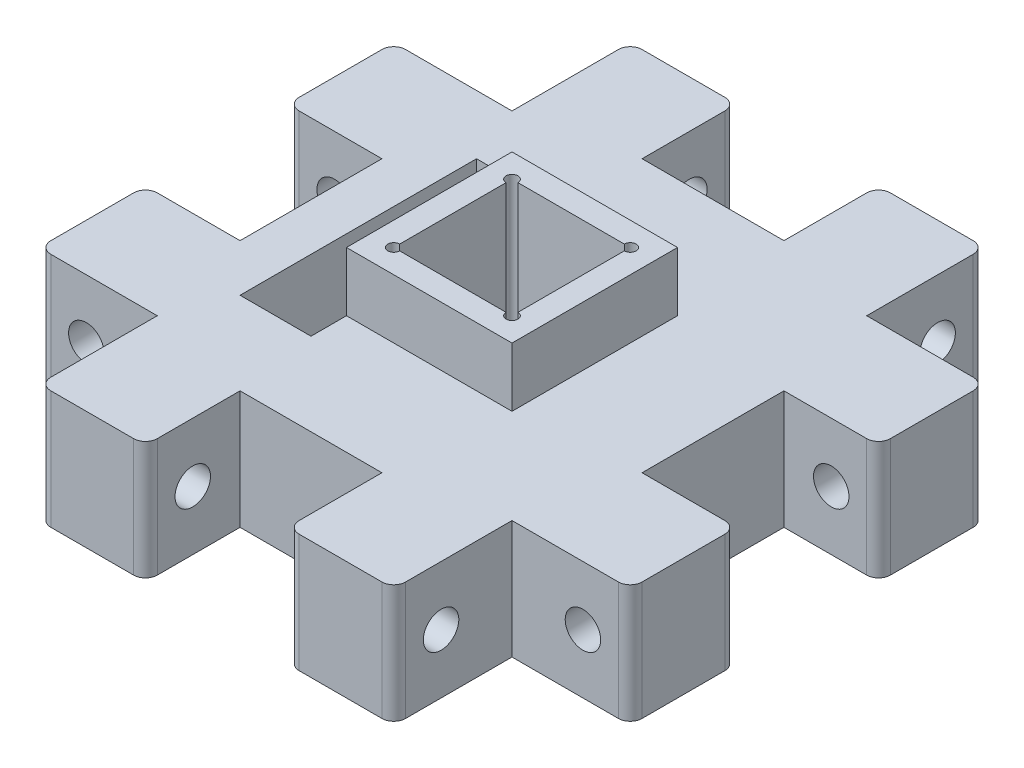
ISO-10303-21;
HEADER;
FILE_DESCRIPTION(('STEP AP214'),'2;1');
FILE_NAME('part.step','',(''),(''),'','','');
FILE_SCHEMA(('AUTOMOTIVE_DESIGN { 1 0 10303 214 1 1 1 1 }'));
ENDSEC;
DATA;
#1=APPLICATION_CONTEXT('core data for automotive mechanical design processes');
#2=APPLICATION_PROTOCOL_DEFINITION('international standard','automotive_design',2000,#1);
#3=PRODUCT_CONTEXT('',#1,'mechanical');
#4=PRODUCT('Part','Part','',(#3));
#5=PRODUCT_RELATED_PRODUCT_CATEGORY('part','',(#4));
#6=PRODUCT_DEFINITION_FORMATION('','',#4);
#7=PRODUCT_DEFINITION_CONTEXT('part definition',#1,'design');
#8=PRODUCT_DEFINITION('design','',#6,#7);
#9=PRODUCT_DEFINITION_SHAPE('','',#8);
#10=(LENGTH_UNIT() NAMED_UNIT(*) SI_UNIT(.MILLI.,.METRE.));
#11=(NAMED_UNIT(*) PLANE_ANGLE_UNIT() SI_UNIT($,.RADIAN.));
#12=(NAMED_UNIT(*) SI_UNIT($,.STERADIAN.) SOLID_ANGLE_UNIT());
#13=UNCERTAINTY_MEASURE_WITH_UNIT(LENGTH_MEASURE(1.E-05),#10,'distance_accuracy_value','');
#14=(GEOMETRIC_REPRESENTATION_CONTEXT(3) GLOBAL_UNCERTAINTY_ASSIGNED_CONTEXT((#13)) GLOBAL_UNIT_ASSIGNED_CONTEXT((#10,
#11,#12)) REPRESENTATION_CONTEXT('',''));
#15=CARTESIAN_POINT('',(0.,0.,0.));
#16=DIRECTION('',(0.,0.,1.));
#17=DIRECTION('',(1.,0.,0.));
#18=AXIS2_PLACEMENT_3D('',#15,#16,#17);
#19=CARTESIAN_POINT('',(0.,10.,0.));
#20=DIRECTION('',(0.,-1.,0.));
#21=DIRECTION('',(0.,0.,-1.));
#22=AXIS2_PLACEMENT_3D('',#19,#20,#21);
#23=PLANE('',#22);
#24=DIRECTION('',(0.,0.,1.));
#25=VECTOR('',#24,1.);
#26=CARTESIAN_POINT('',(-25.,10.,25.));
#27=LINE('',#26,#25);
#28=CARTESIAN_POINT('',(-25.,10.,-14.));
#29=VERTEX_POINT('',#28);
#30=CARTESIAN_POINT('',(-25.,10.,-7.));
#31=VERTEX_POINT('',#30);
#32=EDGE_CURVE('E738',#29,#31,#27,.T.);
#33=ORIENTED_EDGE('',*,*,#32,.T.);
#34=CARTESIAN_POINT('',(-24.,10.,-7.));
#35=DIRECTION('',(0.,-1.,0.));
#36=DIRECTION('',(0.,0.,-1.));
#37=AXIS2_PLACEMENT_3D('',#34,#35,#36);
#38=CIRCLE('',#37,1.);
#39=CARTESIAN_POINT('',(-24.,10.,-6.));
#40=VERTEX_POINT('',#39);
#41=EDGE_CURVE('E794',#31,#40,#38,.F.);
#42=ORIENTED_EDGE('',*,*,#41,.T.);
#43=DIRECTION('',(-1.,0.,0.));
#44=VECTOR('',#43,1.);
#45=CARTESIAN_POINT('',(0.,10.,-5.99999999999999));
#46=LINE('',#45,#44);
#47=CARTESIAN_POINT('',(-17.,10.,-6.));
#48=VERTEX_POINT('',#47);
#49=EDGE_CURVE('E684',#48,#40,#46,.T.);
#50=ORIENTED_EDGE('',*,*,#49,.F.);
#51=DIRECTION('',(0.,0.,-1.));
#52=VECTOR('',#51,1.);
#53=CARTESIAN_POINT('',(-17.,10.,0.));
#54=LINE('',#53,#52);
#55=CARTESIAN_POINT('',(-17.,10.,6.));
#56=VERTEX_POINT('',#55);
#57=EDGE_CURVE('E681',#56,#48,#54,.T.);
#58=ORIENTED_EDGE('',*,*,#57,.F.);
#59=DIRECTION('',(1.,0.,0.));
#60=VECTOR('',#59,1.);
#61=CARTESIAN_POINT('',(0.,10.,6.00000000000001));
#62=LINE('',#61,#60);
#63=CARTESIAN_POINT('',(-24.,10.,6.));
#64=VERTEX_POINT('',#63);
#65=EDGE_CURVE('E679',#64,#56,#62,.T.);
#66=ORIENTED_EDGE('',*,*,#65,.F.);
#67=CARTESIAN_POINT('',(-24.,10.,7.));
#68=DIRECTION('',(0.,-1.,0.));
#69=DIRECTION('',(0.,0.,-1.));
#70=AXIS2_PLACEMENT_3D('',#67,#68,#69);
#71=CIRCLE('',#70,1.);
#72=CARTESIAN_POINT('',(-25.,10.,7.));
#73=VERTEX_POINT('',#72);
#74=EDGE_CURVE('E768',#64,#73,#71,.F.);
#75=ORIENTED_EDGE('',*,*,#74,.T.);
#76=CARTESIAN_POINT('',(-25.,10.,14.));
#77=VERTEX_POINT('',#76);
#78=EDGE_CURVE('E735',#73,#77,#27,.T.);
#79=ORIENTED_EDGE('',*,*,#78,.T.);
#80=CARTESIAN_POINT('',(-24.,10.,14.));
#81=DIRECTION('',(0.,-1.,0.));
#82=DIRECTION('',(0.,0.,-1.));
#83=AXIS2_PLACEMENT_3D('',#80,#81,#82);
#84=CIRCLE('',#83,1.);
#85=CARTESIAN_POINT('',(-24.,10.,15.));
#86=VERTEX_POINT('',#85);
#87=EDGE_CURVE('E766',#77,#86,#84,.F.);
#88=ORIENTED_EDGE('',*,*,#87,.T.);
#89=DIRECTION('',(-1.,0.,0.));
#90=VECTOR('',#89,1.);
#91=CARTESIAN_POINT('',(-25.,10.,15.));
#92=LINE('',#91,#90);
#93=CARTESIAN_POINT('',(-15.,10.,15.));
#94=VERTEX_POINT('',#93);
#95=EDGE_CURVE('E493',#94,#86,#92,.T.);
#96=ORIENTED_EDGE('',*,*,#95,.F.);
#97=DIRECTION('',(0.,0.,-1.));
#98=VECTOR('',#97,1.);
#99=CARTESIAN_POINT('',(-15.,10.,25.));
#100=LINE('',#99,#98);
#101=CARTESIAN_POINT('',(-15.,10.,24.));
#102=VERTEX_POINT('',#101);
#103=EDGE_CURVE('E441',#102,#94,#100,.T.);
#104=ORIENTED_EDGE('',*,*,#103,.F.);
#105=CARTESIAN_POINT('',(-14.,10.,24.));
#106=DIRECTION('',(0.,-1.,0.));
#107=DIRECTION('',(0.,0.,-1.));
#108=AXIS2_PLACEMENT_3D('',#105,#106,#107);
#109=CIRCLE('',#108,1.);
#110=CARTESIAN_POINT('',(-14.,10.,25.));
#111=VERTEX_POINT('',#110);
#112=EDGE_CURVE('E764',#102,#111,#109,.F.);
#113=ORIENTED_EDGE('',*,*,#112,.T.);
#114=DIRECTION('',(1.,0.,0.));
#115=VECTOR('',#114,1.);
#116=CARTESIAN_POINT('',(-25.,10.,25.));
#117=LINE('',#116,#115);
#118=CARTESIAN_POINT('',(-7.,10.,25.));
#119=VERTEX_POINT('',#118);
#120=EDGE_CURVE('E739',#111,#119,#117,.T.);
#121=ORIENTED_EDGE('',*,*,#120,.T.);
#122=CARTESIAN_POINT('',(-7.,10.,24.));
#123=DIRECTION('',(0.,-1.,0.));
#124=DIRECTION('',(0.,0.,-1.));
#125=AXIS2_PLACEMENT_3D('',#122,#123,#124);
#126=CIRCLE('',#125,1.);
#127=CARTESIAN_POINT('',(-6.,10.,24.));
#128=VERTEX_POINT('',#127);
#129=EDGE_CURVE('E770',#119,#128,#126,.F.);
#130=ORIENTED_EDGE('',*,*,#129,.T.);
#131=DIRECTION('',(0.,0.,1.));
#132=VECTOR('',#131,1.);
#133=CARTESIAN_POINT('',(-6.,10.,0.));
#134=LINE('',#133,#132);
#135=CARTESIAN_POINT('',(-6.,10.,17.));
#136=VERTEX_POINT('',#135);
#137=EDGE_CURVE('E666',#136,#128,#134,.T.);
#138=ORIENTED_EDGE('',*,*,#137,.F.);
#139=DIRECTION('',(-1.,0.,0.));
#140=VECTOR('',#139,1.);
#141=CARTESIAN_POINT('',(0.,10.,17.));
#142=LINE('',#141,#140);
#143=CARTESIAN_POINT('',(6.,10.,17.));
#144=VERTEX_POINT('',#143);
#145=EDGE_CURVE('E663',#144,#136,#142,.T.);
#146=ORIENTED_EDGE('',*,*,#145,.F.);
#147=DIRECTION('',(0.,0.,-1.));
#148=VECTOR('',#147,1.);
#149=CARTESIAN_POINT('',(6.00000000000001,10.,0.));
#150=LINE('',#149,#148);
#151=CARTESIAN_POINT('',(6.,10.,24.));
#152=VERTEX_POINT('',#151);
#153=EDGE_CURVE('E661',#152,#144,#150,.T.);
#154=ORIENTED_EDGE('',*,*,#153,.F.);
#155=CARTESIAN_POINT('',(7.,10.,24.));
#156=DIRECTION('',(0.,-1.,0.));
#157=DIRECTION('',(0.,0.,-1.));
#158=AXIS2_PLACEMENT_3D('',#155,#156,#157);
#159=CIRCLE('',#158,1.);
#160=CARTESIAN_POINT('',(7.,10.,25.));
#161=VERTEX_POINT('',#160);
#162=EDGE_CURVE('E772',#152,#161,#159,.F.);
#163=ORIENTED_EDGE('',*,*,#162,.T.);
#164=CARTESIAN_POINT('',(14.,10.,25.));
#165=VERTEX_POINT('',#164);
#166=EDGE_CURVE('E743',#161,#165,#117,.T.);
#167=ORIENTED_EDGE('',*,*,#166,.T.);
#168=CARTESIAN_POINT('',(14.,10.,24.));
#169=DIRECTION('',(0.,-1.,0.));
#170=DIRECTION('',(0.,0.,-1.));
#171=AXIS2_PLACEMENT_3D('',#168,#169,#170);
#172=CIRCLE('',#171,1.);
#173=CARTESIAN_POINT('',(15.,10.,24.));
#174=VERTEX_POINT('',#173);
#175=EDGE_CURVE('E774',#165,#174,#172,.F.);
#176=ORIENTED_EDGE('',*,*,#175,.T.);
#177=DIRECTION('',(0.,0.,1.));
#178=VECTOR('',#177,1.);
#179=CARTESIAN_POINT('',(15.,10.,25.));
#180=LINE('',#179,#178);
#181=CARTESIAN_POINT('',(15.,10.,15.));
#182=VERTEX_POINT('',#181);
#183=EDGE_CURVE('E462',#182,#174,#180,.T.);
#184=ORIENTED_EDGE('',*,*,#183,.F.);
#185=DIRECTION('',(-1.,0.,0.));
#186=VECTOR('',#185,1.);
#187=CARTESIAN_POINT('',(25.,10.,15.));
#188=LINE('',#187,#186);
#189=CARTESIAN_POINT('',(24.,10.,15.));
#190=VERTEX_POINT('',#189);
#191=EDGE_CURVE('E421',#190,#182,#188,.T.);
#192=ORIENTED_EDGE('',*,*,#191,.F.);
#193=CARTESIAN_POINT('',(24.,10.,14.));
#194=DIRECTION('',(0.,-1.,0.));
#195=DIRECTION('',(0.,0.,-1.));
#196=AXIS2_PLACEMENT_3D('',#193,#194,#195);
#197=CIRCLE('',#196,1.);
#198=CARTESIAN_POINT('',(25.,10.,14.));
#199=VERTEX_POINT('',#198);
#200=EDGE_CURVE('E776',#190,#199,#197,.F.);
#201=ORIENTED_EDGE('',*,*,#200,.T.);
#202=DIRECTION('',(0.,0.,-1.));
#203=VECTOR('',#202,1.);
#204=CARTESIAN_POINT('',(25.,10.,25.));
#205=LINE('',#204,#203);
#206=CARTESIAN_POINT('',(25.,10.,6.99999999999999));
#207=VERTEX_POINT('',#206);
#208=EDGE_CURVE('E729',#199,#207,#205,.T.);
#209=ORIENTED_EDGE('',*,*,#208,.T.);
#210=CARTESIAN_POINT('',(24.,10.,6.99999999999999));
#211=DIRECTION('',(0.,-1.,0.));
#212=DIRECTION('',(0.,0.,-1.));
#213=AXIS2_PLACEMENT_3D('',#210,#211,#212);
#214=CIRCLE('',#213,1.);
#215=CARTESIAN_POINT('',(24.,10.,5.99999999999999));
#216=VERTEX_POINT('',#215);
#217=EDGE_CURVE('E778',#207,#216,#214,.F.);
#218=ORIENTED_EDGE('',*,*,#217,.T.);
#219=DIRECTION('',(1.,0.,0.));
#220=VECTOR('',#219,1.);
#221=CARTESIAN_POINT('',(0.,10.,6.));
#222=LINE('',#221,#220);
#223=CARTESIAN_POINT('',(17.,10.,5.99999999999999));
#224=VERTEX_POINT('',#223);
#225=EDGE_CURVE('E642',#224,#216,#222,.T.);
#226=ORIENTED_EDGE('',*,*,#225,.F.);
#227=DIRECTION('',(0.,0.,1.));
#228=VECTOR('',#227,1.);
#229=CARTESIAN_POINT('',(17.,10.,0.));
#230=LINE('',#229,#228);
#231=CARTESIAN_POINT('',(17.,10.,-6.00000000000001));
#232=VERTEX_POINT('',#231);
#233=EDGE_CURVE('E639',#232,#224,#230,.T.);
#234=ORIENTED_EDGE('',*,*,#233,.F.);
#235=DIRECTION('',(-1.,0.,0.));
#236=VECTOR('',#235,1.);
#237=CARTESIAN_POINT('',(0.,10.,-6.00000000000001));
#238=LINE('',#237,#236);
#239=CARTESIAN_POINT('',(24.,10.,-6.00000000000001));
#240=VERTEX_POINT('',#239);
#241=EDGE_CURVE('E645',#240,#232,#238,.T.);
#242=ORIENTED_EDGE('',*,*,#241,.F.);
#243=CARTESIAN_POINT('',(24.,10.,-7.00000000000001));
#244=DIRECTION('',(0.,-1.,0.));
#245=DIRECTION('',(0.,0.,-1.));
#246=AXIS2_PLACEMENT_3D('',#243,#244,#245);
#247=CIRCLE('',#246,1.);
#248=CARTESIAN_POINT('',(25.,10.,-7.));
#249=VERTEX_POINT('',#248);
#250=EDGE_CURVE('E780',#240,#249,#247,.F.);
#251=ORIENTED_EDGE('',*,*,#250,.T.);
#252=CARTESIAN_POINT('',(25.,10.,-14.));
#253=VERTEX_POINT('',#252);
#254=EDGE_CURVE('E726',#249,#253,#205,.T.);
#255=ORIENTED_EDGE('',*,*,#254,.T.);
#256=CARTESIAN_POINT('',(24.,10.,-14.));
#257=DIRECTION('',(0.,-1.,0.));
#258=DIRECTION('',(0.,0.,-1.));
#259=AXIS2_PLACEMENT_3D('',#256,#257,#258);
#260=CIRCLE('',#259,1.);
#261=CARTESIAN_POINT('',(24.,10.,-15.));
#262=VERTEX_POINT('',#261);
#263=EDGE_CURVE('E782',#253,#262,#260,.F.);
#264=ORIENTED_EDGE('',*,*,#263,.T.);
#265=DIRECTION('',(1.,0.,0.));
#266=VECTOR('',#265,1.);
#267=CARTESIAN_POINT('',(25.,10.,-15.));
#268=LINE('',#267,#266);
#269=CARTESIAN_POINT('',(15.,10.,-15.));
#270=VERTEX_POINT('',#269);
#271=EDGE_CURVE('E456',#270,#262,#268,.T.);
#272=ORIENTED_EDGE('',*,*,#271,.F.);
#273=DIRECTION('',(0.,0.,1.));
#274=VECTOR('',#273,1.);
#275=CARTESIAN_POINT('',(15.,10.,-25.));
#276=LINE('',#275,#274);
#277=CARTESIAN_POINT('',(15.,10.,-24.));
#278=VERTEX_POINT('',#277);
#279=EDGE_CURVE('E442',#278,#270,#276,.T.);
#280=ORIENTED_EDGE('',*,*,#279,.F.);
#281=CARTESIAN_POINT('',(14.,10.,-24.));
#282=DIRECTION('',(0.,-1.,0.));
#283=DIRECTION('',(0.,0.,-1.));
#284=AXIS2_PLACEMENT_3D('',#281,#282,#283);
#285=CIRCLE('',#284,1.);
#286=CARTESIAN_POINT('',(14.,10.,-25.));
#287=VERTEX_POINT('',#286);
#288=EDGE_CURVE('E784',#278,#287,#285,.F.);
#289=ORIENTED_EDGE('',*,*,#288,.T.);
#290=DIRECTION('',(-1.,0.,0.));
#291=VECTOR('',#290,1.);
#292=CARTESIAN_POINT('',(-25.,10.,-25.));
#293=LINE('',#292,#291);
#294=CARTESIAN_POINT('',(7.,10.,-25.));
#295=VERTEX_POINT('',#294);
#296=EDGE_CURVE('E734',#287,#295,#293,.T.);
#297=ORIENTED_EDGE('',*,*,#296,.T.);
#298=CARTESIAN_POINT('',(7.,10.,-24.));
#299=DIRECTION('',(0.,-1.,0.));
#300=DIRECTION('',(0.,0.,-1.));
#301=AXIS2_PLACEMENT_3D('',#298,#299,#300);
#302=CIRCLE('',#301,1.);
#303=CARTESIAN_POINT('',(5.99999999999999,10.,-24.));
#304=VERTEX_POINT('',#303);
#305=EDGE_CURVE('E786',#295,#304,#302,.F.);
#306=ORIENTED_EDGE('',*,*,#305,.T.);
#307=DIRECTION('',(0.,0.,-1.));
#308=VECTOR('',#307,1.);
#309=CARTESIAN_POINT('',(6.,10.,0.));
#310=LINE('',#309,#308);
#311=CARTESIAN_POINT('',(6.,10.,-17.));
#312=VERTEX_POINT('',#311);
#313=EDGE_CURVE('E703',#312,#304,#310,.T.);
#314=ORIENTED_EDGE('',*,*,#313,.F.);
#315=DIRECTION('',(1.,0.,0.));
#316=VECTOR('',#315,1.);
#317=CARTESIAN_POINT('',(0.,10.,-17.));
#318=LINE('',#317,#316);
#319=CARTESIAN_POINT('',(-6.00000000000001,10.,-17.));
#320=VERTEX_POINT('',#319);
#321=EDGE_CURVE('E700',#320,#312,#318,.T.);
#322=ORIENTED_EDGE('',*,*,#321,.F.);
#323=DIRECTION('',(0.,0.,1.));
#324=VECTOR('',#323,1.);
#325=CARTESIAN_POINT('',(-6.00000000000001,10.,0.));
#326=LINE('',#325,#324);
#327=CARTESIAN_POINT('',(-6.,10.,-24.));
#328=VERTEX_POINT('',#327);
#329=EDGE_CURVE('E698',#328,#320,#326,.T.);
#330=ORIENTED_EDGE('',*,*,#329,.F.);
#331=CARTESIAN_POINT('',(-7.,10.,-24.));
#332=DIRECTION('',(0.,-1.,0.));
#333=DIRECTION('',(0.,0.,-1.));
#334=AXIS2_PLACEMENT_3D('',#331,#332,#333);
#335=CIRCLE('',#334,1.);
#336=CARTESIAN_POINT('',(-7.,10.,-25.));
#337=VERTEX_POINT('',#336);
#338=EDGE_CURVE('E788',#328,#337,#335,.F.);
#339=ORIENTED_EDGE('',*,*,#338,.T.);
#340=CARTESIAN_POINT('',(-14.,10.,-25.));
#341=VERTEX_POINT('',#340);
#342=EDGE_CURVE('E731',#337,#341,#293,.T.);
#343=ORIENTED_EDGE('',*,*,#342,.T.);
#344=CARTESIAN_POINT('',(-14.,10.,-24.));
#345=DIRECTION('',(0.,-1.,0.));
#346=DIRECTION('',(0.,0.,-1.));
#347=AXIS2_PLACEMENT_3D('',#344,#345,#346);
#348=CIRCLE('',#347,1.);
#349=CARTESIAN_POINT('',(-15.,10.,-24.));
#350=VERTEX_POINT('',#349);
#351=EDGE_CURVE('E790',#341,#350,#348,.F.);
#352=ORIENTED_EDGE('',*,*,#351,.T.);
#353=DIRECTION('',(0.,0.,-1.));
#354=VECTOR('',#353,1.);
#355=CARTESIAN_POINT('',(-15.,10.,-25.));
#356=LINE('',#355,#354);
#357=CARTESIAN_POINT('',(-15.,10.,-15.));
#358=VERTEX_POINT('',#357);
#359=EDGE_CURVE('E463',#358,#350,#356,.T.);
#360=ORIENTED_EDGE('',*,*,#359,.F.);
#361=DIRECTION('',(1.,0.,0.));
#362=VECTOR('',#361,1.);
#363=CARTESIAN_POINT('',(-25.,10.,-15.));
#364=LINE('',#363,#362);
#365=CARTESIAN_POINT('',(-24.,10.,-15.));
#366=VERTEX_POINT('',#365);
#367=EDGE_CURVE('E466',#366,#358,#364,.T.);
#368=ORIENTED_EDGE('',*,*,#367,.F.);
#369=CARTESIAN_POINT('',(-24.,10.,-14.));
#370=DIRECTION('',(0.,-1.,0.));
#371=DIRECTION('',(0.,0.,-1.));
#372=AXIS2_PLACEMENT_3D('',#369,#370,#371);
#373=CIRCLE('',#372,1.);
#374=EDGE_CURVE('E792',#366,#29,#373,.F.);
#375=ORIENTED_EDGE('',*,*,#374,.T.);
#376=EDGE_LOOP('',(#33,#42,#50,#58,#66,#75,#79,#88,#96,#104,#113,#121,#130,#138,#146,#154,#163,
#167,#176,#184,#192,#201,#209,#218,#226,#234,#242,#251,#255,#264,#272,#280,#289,#297,#306,#314,
#322,#330,#339,#343,#352,#360,#368,#375));
#377=FACE_BOUND('',#376,.T.);
#378=DIRECTION('',(1.,0.,0.));
#379=VECTOR('',#378,1.);
#380=CARTESIAN_POINT('',(7.,10.,7.));
#381=LINE('',#380,#379);
#382=CARTESIAN_POINT('',(-7.,10.,7.));
#383=VERTEX_POINT('',#382);
#384=CARTESIAN_POINT('',(7.,10.,7.));
#385=VERTEX_POINT('',#384);
#386=EDGE_CURVE('E523',#383,#385,#381,.T.);
#387=ORIENTED_EDGE('',*,*,#386,.F.);
#388=DIRECTION('',(0.,0.,-1.));
#389=VECTOR('',#388,1.);
#390=CARTESIAN_POINT('',(-7.,10.,10.));
#391=LINE('',#390,#389);
#392=CARTESIAN_POINT('',(-7.,10.,10.));
#393=VERTEX_POINT('',#392);
#394=EDGE_CURVE('E584',#393,#383,#391,.T.);
#395=ORIENTED_EDGE('',*,*,#394,.F.);
#396=DIRECTION('',(1.,0.,0.));
#397=VECTOR('',#396,1.);
#398=CARTESIAN_POINT('',(-13.,10.,10.));
#399=LINE('',#398,#397);
#400=CARTESIAN_POINT('',(-13.,10.,10.));
#401=VERTEX_POINT('',#400);
#402=EDGE_CURVE('E601',#401,#393,#399,.T.);
#403=ORIENTED_EDGE('',*,*,#402,.F.);
#404=DIRECTION('',(0.,0.,1.));
#405=VECTOR('',#404,1.);
#406=CARTESIAN_POINT('',(-13.,10.,10.));
#407=LINE('',#406,#405);
#408=CARTESIAN_POINT('',(-13.,10.,-10.));
#409=VERTEX_POINT('',#408);
#410=EDGE_CURVE('E578',#409,#401,#407,.T.);
#411=ORIENTED_EDGE('',*,*,#410,.F.);
#412=DIRECTION('',(-1.,0.,0.));
#413=VECTOR('',#412,1.);
#414=CARTESIAN_POINT('',(-7.,10.,-10.));
#415=LINE('',#414,#413);
#416=CARTESIAN_POINT('',(-7.,10.,-10.));
#417=VERTEX_POINT('',#416);
#418=EDGE_CURVE('E580',#417,#409,#415,.T.);
#419=ORIENTED_EDGE('',*,*,#418,.F.);
#420=CARTESIAN_POINT('',(-7.,10.,-7.));
#421=VERTEX_POINT('',#420);
#422=EDGE_CURVE('E583',#421,#417,#391,.T.);
#423=ORIENTED_EDGE('',*,*,#422,.F.);
#424=DIRECTION('',(-1.,0.,0.));
#425=VECTOR('',#424,1.);
#426=CARTESIAN_POINT('',(6.99999999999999,10.,-7.));
#427=LINE('',#426,#425);
#428=CARTESIAN_POINT('',(6.99999999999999,10.,-7.));
#429=VERTEX_POINT('',#428);
#430=EDGE_CURVE('E528',#429,#421,#427,.T.);
#431=ORIENTED_EDGE('',*,*,#430,.F.);
#432=DIRECTION('',(0.,0.,-1.));
#433=VECTOR('',#432,1.);
#434=CARTESIAN_POINT('',(6.99999999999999,10.,-7.));
#435=LINE('',#434,#433);
#436=EDGE_CURVE('E536',#385,#429,#435,.T.);
#437=ORIENTED_EDGE('',*,*,#436,.F.);
#438=EDGE_LOOP('',(#387,#395,#403,#411,#419,#423,#431,#437));
#439=FACE_BOUND('',#438,.T.);
#440=ADVANCED_FACE('F34',(#377,#439),#23,.F.);
#441=CARTESIAN_POINT('',(29.2426406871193,5.,-21.));
#442=DIRECTION('',(-1.,0.,0.));
#443=DIRECTION('',(0.,0.,1.));
#444=AXIS2_PLACEMENT_3D('',#441,#442,#443);
#445=CYLINDRICAL_SURFACE('',#444,1.5);
#446=CARTESIAN_POINT('',(15.,5.,-21.));
#447=DIRECTION('',(-1.,0.,0.));
#448=DIRECTION('',(0.,0.,1.));
#449=AXIS2_PLACEMENT_3D('',#446,#447,#448);
#450=CIRCLE('',#449,1.5);
#451=CARTESIAN_POINT('',(15.,5.,-19.5));
#452=VERTEX_POINT('',#451);
#453=EDGE_CURVE('E459',#452,#452,#450,.T.);
#454=ORIENTED_EDGE('',*,*,#453,.F.);
#455=EDGE_LOOP('',(#454));
#456=FACE_BOUND('',#455,.T.);
#457=CARTESIAN_POINT('',(6.,5.,-21.));
#458=DIRECTION('',(1.,0.,0.));
#459=DIRECTION('',(0.,0.,-1.));
#460=AXIS2_PLACEMENT_3D('',#457,#458,#459);
#461=CIRCLE('',#460,1.5);
#462=CARTESIAN_POINT('',(6.,5.,-22.5));
#463=VERTEX_POINT('',#462);
#464=EDGE_CURVE('E628',#463,#463,#461,.T.);
#465=ORIENTED_EDGE('',*,*,#464,.F.);
#466=EDGE_LOOP('',(#465));
#467=FACE_BOUND('',#466,.T.);
#468=ADVANCED_FACE('F989',(#456,#467),#445,.F.);
#469=CARTESIAN_POINT('',(29.2426406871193,5.,21.));
#470=DIRECTION('',(-1.,0.,0.));
#471=DIRECTION('',(0.,0.,1.));
#472=AXIS2_PLACEMENT_3D('',#469,#470,#471);
#473=CYLINDRICAL_SURFACE('',#472,1.5);
#474=CARTESIAN_POINT('',(15.,5.,21.));
#475=DIRECTION('',(-1.,0.,0.));
#476=DIRECTION('',(0.,0.,1.));
#477=AXIS2_PLACEMENT_3D('',#474,#475,#476);
#478=CIRCLE('',#477,1.5);
#479=CARTESIAN_POINT('',(15.,5.,22.5));
#480=VERTEX_POINT('',#479);
#481=EDGE_CURVE('E428',#480,#480,#478,.T.);
#482=ORIENTED_EDGE('',*,*,#481,.F.);
#483=EDGE_LOOP('',(#482));
#484=FACE_BOUND('',#483,.T.);
#485=CARTESIAN_POINT('',(6.,5.,21.));
#486=DIRECTION('',(1.,0.,0.));
#487=DIRECTION('',(0.,0.,-1.));
#488=AXIS2_PLACEMENT_3D('',#485,#486,#487);
#489=CIRCLE('',#488,1.5);
#490=CARTESIAN_POINT('',(6.,5.,19.5));
#491=VERTEX_POINT('',#490);
#492=EDGE_CURVE('E619',#491,#491,#489,.T.);
#493=ORIENTED_EDGE('',*,*,#492,.F.);
#494=EDGE_LOOP('',(#493));
#495=FACE_BOUND('',#494,.T.);
#496=ADVANCED_FACE('F994',(#484,#495),#473,.F.);
#497=CARTESIAN_POINT('',(-21.,5.,29.2426406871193));
#498=DIRECTION('',(0.,0.,-1.));
#499=DIRECTION('',(-1.,0.,0.));
#500=AXIS2_PLACEMENT_3D('',#497,#498,#499);
#501=CYLINDRICAL_SURFACE('',#500,1.5);
#502=CARTESIAN_POINT('',(-21.,5.,15.));
#503=DIRECTION('',(0.,0.,-1.));
#504=DIRECTION('',(-1.,0.,0.));
#505=AXIS2_PLACEMENT_3D('',#502,#503,#504);
#506=CIRCLE('',#505,1.5);
#507=CARTESIAN_POINT('',(-22.5,5.,15.));
#508=VERTEX_POINT('',#507);
#509=EDGE_CURVE('E490',#508,#508,#506,.T.);
#510=ORIENTED_EDGE('',*,*,#509,.F.);
#511=EDGE_LOOP('',(#510));
#512=FACE_BOUND('',#511,.T.);
#513=CARTESIAN_POINT('',(-21.,5.,6.00000000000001));
#514=DIRECTION('',(0.,0.,1.));
#515=DIRECTION('',(1.,0.,0.));
#516=AXIS2_PLACEMENT_3D('',#513,#514,#515);
#517=CIRCLE('',#516,1.5);
#518=CARTESIAN_POINT('',(-19.5,5.,6.00000000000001));
#519=VERTEX_POINT('',#518);
#520=EDGE_CURVE('E625',#519,#519,#517,.T.);
#521=ORIENTED_EDGE('',*,*,#520,.F.);
#522=EDGE_LOOP('',(#521));
#523=FACE_BOUND('',#522,.T.);
#524=ADVANCED_FACE('F1378',(#512,#523),#501,.F.);
#525=CARTESIAN_POINT('',(25.,10.,25.));
#526=DIRECTION('',(-1.,0.,0.));
#527=DIRECTION('',(0.,0.,1.));
#528=AXIS2_PLACEMENT_3D('',#525,#526,#527);
#529=PLANE('',#528);
#530=DIRECTION('',(0.,0.,-1.));
#531=VECTOR('',#530,1.);
#532=CARTESIAN_POINT('',(25.,0.,25.));
#533=LINE('',#532,#531);
#534=CARTESIAN_POINT('',(25.,0.,-7.));
#535=VERTEX_POINT('',#534);
#536=CARTESIAN_POINT('',(25.,0.,-14.));
#537=VERTEX_POINT('',#536);
#538=EDGE_CURVE('E725',#535,#537,#533,.T.);
#539=ORIENTED_EDGE('',*,*,#538,.T.);
#540=DIRECTION('',(0.,-1.,0.));
#541=VECTOR('',#540,1.);
#542=CARTESIAN_POINT('',(25.,10.,-14.));
#543=LINE('',#542,#541);
#544=EDGE_CURVE('E855',#537,#253,#543,.F.);
#545=ORIENTED_EDGE('',*,*,#544,.T.);
#546=ORIENTED_EDGE('',*,*,#254,.F.);
#547=DIRECTION('',(0.,1.,0.));
#548=VECTOR('',#547,1.);
#549=CARTESIAN_POINT('',(25.,10.,-7.));
#550=LINE('',#549,#548);
#551=EDGE_CURVE('E853',#249,#535,#550,.F.);
#552=ORIENTED_EDGE('',*,*,#551,.T.);
#553=EDGE_LOOP('',(#539,#545,#546,#552));
#554=FACE_BOUND('',#553,.T.);
#555=ADVANCED_FACE('F1017',(#554),#529,.F.);
#556=CARTESIAN_POINT('',(-25.,10.,25.));
#557=DIRECTION('',(1.,0.,0.));
#558=DIRECTION('',(0.,0.,-1.));
#559=AXIS2_PLACEMENT_3D('',#556,#557,#558);
#560=PLANE('',#559);
#561=ORIENTED_EDGE('',*,*,#78,.F.);
#562=DIRECTION('',(0.,1.,0.));
#563=VECTOR('',#562,1.);
#564=CARTESIAN_POINT('',(-25.,10.,7.));
#565=LINE('',#564,#563);
#566=CARTESIAN_POINT('',(-25.,0.,7.));
#567=VERTEX_POINT('',#566);
#568=EDGE_CURVE('E891',#73,#567,#565,.F.);
#569=ORIENTED_EDGE('',*,*,#568,.T.);
#570=DIRECTION('',(0.,0.,1.));
#571=VECTOR('',#570,1.);
#572=CARTESIAN_POINT('',(-25.,0.,25.));
#573=LINE('',#572,#571);
#574=CARTESIAN_POINT('',(-25.,0.,14.));
#575=VERTEX_POINT('',#574);
#576=EDGE_CURVE('E750',#567,#575,#573,.T.);
#577=ORIENTED_EDGE('',*,*,#576,.T.);
#578=DIRECTION('',(0.,-1.,0.));
#579=VECTOR('',#578,1.);
#580=CARTESIAN_POINT('',(-25.,10.,14.));
#581=LINE('',#580,#579);
#582=EDGE_CURVE('E889',#575,#77,#581,.F.);
#583=ORIENTED_EDGE('',*,*,#582,.T.);
#584=EDGE_LOOP('',(#561,#569,#577,#583));
#585=FACE_BOUND('',#584,.T.);
#586=ADVANCED_FACE('F979',(#585),#560,.F.);
#587=CARTESIAN_POINT('',(-25.,10.,25.));
#588=DIRECTION('',(0.,0.,-1.));
#589=DIRECTION('',(-1.,0.,0.));
#590=AXIS2_PLACEMENT_3D('',#587,#588,#589);
#591=PLANE('',#590);
#592=DIRECTION('',(1.,0.,0.));
#593=VECTOR('',#592,1.);
#594=CARTESIAN_POINT('',(-25.,0.,25.));
#595=LINE('',#594,#593);
#596=CARTESIAN_POINT('',(7.,0.,25.));
#597=VERTEX_POINT('',#596);
#598=CARTESIAN_POINT('',(14.,0.,25.));
#599=VERTEX_POINT('',#598);
#600=EDGE_CURVE('E756',#597,#599,#595,.T.);
#601=ORIENTED_EDGE('',*,*,#600,.T.);
#602=DIRECTION('',(0.,-1.,0.));
#603=VECTOR('',#602,1.);
#604=CARTESIAN_POINT('',(14.,10.,25.));
#605=LINE('',#604,#603);
#606=EDGE_CURVE('E873',#599,#165,#605,.F.);
#607=ORIENTED_EDGE('',*,*,#606,.T.);
#608=ORIENTED_EDGE('',*,*,#166,.F.);
#609=DIRECTION('',(0.,1.,0.));
#610=VECTOR('',#609,1.);
#611=CARTESIAN_POINT('',(7.,10.,25.));
#612=LINE('',#611,#610);
#613=EDGE_CURVE('E871',#161,#597,#612,.F.);
#614=ORIENTED_EDGE('',*,*,#613,.T.);
#615=EDGE_LOOP('',(#601,#607,#608,#614));
#616=FACE_BOUND('',#615,.T.);
#617=ADVANCED_FACE('F946',(#616),#591,.F.);
#618=CARTESIAN_POINT('',(-25.,10.,-25.));
#619=DIRECTION('',(0.,0.,1.));
#620=DIRECTION('',(1.,0.,0.));
#621=AXIS2_PLACEMENT_3D('',#618,#619,#620);
#622=PLANE('',#621);
#623=DIRECTION('',(-1.,0.,0.));
#624=VECTOR('',#623,1.);
#625=CARTESIAN_POINT('',(-25.,0.,-25.));
#626=LINE('',#625,#624);
#627=CARTESIAN_POINT('',(-7.,0.,-25.));
#628=VERTEX_POINT('',#627);
#629=CARTESIAN_POINT('',(-14.,0.,-25.));
#630=VERTEX_POINT('',#629);
#631=EDGE_CURVE('E746',#628,#630,#626,.T.);
#632=ORIENTED_EDGE('',*,*,#631,.T.);
#633=DIRECTION('',(0.,-1.,0.));
#634=VECTOR('',#633,1.);
#635=CARTESIAN_POINT('',(-14.,10.,-25.));
#636=LINE('',#635,#634);
#637=EDGE_CURVE('E835',#630,#341,#636,.F.);
#638=ORIENTED_EDGE('',*,*,#637,.T.);
#639=ORIENTED_EDGE('',*,*,#342,.F.);
#640=DIRECTION('',(0.,1.,0.));
#641=VECTOR('',#640,1.);
#642=CARTESIAN_POINT('',(-7.,10.,-25.));
#643=LINE('',#642,#641);
#644=EDGE_CURVE('E833',#337,#628,#643,.F.);
#645=ORIENTED_EDGE('',*,*,#644,.T.);
#646=EDGE_LOOP('',(#632,#638,#639,#645));
#647=FACE_BOUND('',#646,.T.);
#648=ADVANCED_FACE('F1005',(#647),#622,.F.);
#649=CARTESIAN_POINT('',(0.,0.,0.));
#650=DIRECTION('',(0.,-1.,0.));
#651=DIRECTION('',(0.,0.,-1.));
#652=AXIS2_PLACEMENT_3D('',#649,#650,#651);
#653=PLANE('',#652);
#654=DIRECTION('',(-1.,0.,0.));
#655=VECTOR('',#654,1.);
#656=CARTESIAN_POINT('',(0.,0.,-5.99999999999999));
#657=LINE('',#656,#655);
#658=CARTESIAN_POINT('',(-17.,0.,-6.));
#659=VERTEX_POINT('',#658);
#660=CARTESIAN_POINT('',(-24.,0.,-6.));
#661=VERTEX_POINT('',#660);
#662=EDGE_CURVE('E632',#659,#661,#657,.T.);
#663=ORIENTED_EDGE('',*,*,#662,.T.);
#664=CARTESIAN_POINT('',(-24.,0.,-7.));
#665=DIRECTION('',(0.,-1.,0.));
#666=DIRECTION('',(0.,0.,-1.));
#667=AXIS2_PLACEMENT_3D('',#664,#665,#666);
#668=CIRCLE('',#667,1.);
#669=CARTESIAN_POINT('',(-25.,0.,-7.));
#670=VERTEX_POINT('',#669);
#671=EDGE_CURVE('E826',#661,#670,#668,.T.);
#672=ORIENTED_EDGE('',*,*,#671,.T.);
#673=CARTESIAN_POINT('',(-25.,0.,-14.));
#674=VERTEX_POINT('',#673);
#675=EDGE_CURVE('E753',#674,#670,#573,.T.);
#676=ORIENTED_EDGE('',*,*,#675,.F.);
#677=CARTESIAN_POINT('',(-24.,0.,-14.));
#678=DIRECTION('',(0.,-1.,0.));
#679=DIRECTION('',(0.,0.,-1.));
#680=AXIS2_PLACEMENT_3D('',#677,#678,#679);
#681=CIRCLE('',#680,1.);
#682=CARTESIAN_POINT('',(-24.,0.,-15.));
#683=VERTEX_POINT('',#682);
#684=EDGE_CURVE('E824',#674,#683,#681,.T.);
#685=ORIENTED_EDGE('',*,*,#684,.T.);
#686=DIRECTION('',(-1.,0.,0.));
#687=VECTOR('',#686,1.);
#688=CARTESIAN_POINT('',(-25.,0.,-15.));
#689=LINE('',#688,#687);
#690=CARTESIAN_POINT('',(-15.,0.,-15.));
#691=VERTEX_POINT('',#690);
#692=EDGE_CURVE('E470',#691,#683,#689,.T.);
#693=ORIENTED_EDGE('',*,*,#692,.F.);
#694=DIRECTION('',(0.,0.,1.));
#695=VECTOR('',#694,1.);
#696=CARTESIAN_POINT('',(-15.,0.,-25.));
#697=LINE('',#696,#695);
#698=CARTESIAN_POINT('',(-15.,0.,-24.));
#699=VERTEX_POINT('',#698);
#700=EDGE_CURVE('E468',#699,#691,#697,.T.);
#701=ORIENTED_EDGE('',*,*,#700,.F.);
#702=CARTESIAN_POINT('',(-14.,0.,-24.));
#703=DIRECTION('',(0.,-1.,0.));
#704=DIRECTION('',(0.,0.,-1.));
#705=AXIS2_PLACEMENT_3D('',#702,#703,#704);
#706=CIRCLE('',#705,1.);
#707=EDGE_CURVE('E822',#699,#630,#706,.T.);
#708=ORIENTED_EDGE('',*,*,#707,.T.);
#709=ORIENTED_EDGE('',*,*,#631,.F.);
#710=CARTESIAN_POINT('',(-7.,0.,-24.));
#711=DIRECTION('',(0.,-1.,0.));
#712=DIRECTION('',(0.,0.,-1.));
#713=AXIS2_PLACEMENT_3D('',#710,#711,#712);
#714=CIRCLE('',#713,1.);
#715=CARTESIAN_POINT('',(-6.,0.,-24.));
#716=VERTEX_POINT('',#715);
#717=EDGE_CURVE('E820',#628,#716,#714,.T.);
#718=ORIENTED_EDGE('',*,*,#717,.T.);
#719=DIRECTION('',(0.,0.,1.));
#720=VECTOR('',#719,1.);
#721=CARTESIAN_POINT('',(-6.00000000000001,0.,0.));
#722=LINE('',#721,#720);
#723=CARTESIAN_POINT('',(-6.00000000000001,0.,-17.));
#724=VERTEX_POINT('',#723);
#725=EDGE_CURVE('E696',#716,#724,#722,.T.);
#726=ORIENTED_EDGE('',*,*,#725,.T.);
#727=DIRECTION('',(1.,0.,0.));
#728=VECTOR('',#727,1.);
#729=CARTESIAN_POINT('',(0.,0.,-17.));
#730=LINE('',#729,#728);
#731=CARTESIAN_POINT('',(6.,0.,-17.));
#732=VERTEX_POINT('',#731);
#733=EDGE_CURVE('E709',#724,#732,#730,.T.);
#734=ORIENTED_EDGE('',*,*,#733,.T.);
#735=DIRECTION('',(0.,0.,-1.));
#736=VECTOR('',#735,1.);
#737=CARTESIAN_POINT('',(6.,0.,0.));
#738=LINE('',#737,#736);
#739=CARTESIAN_POINT('',(5.99999999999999,0.,-24.));
#740=VERTEX_POINT('',#739);
#741=EDGE_CURVE('E654',#732,#740,#738,.T.);
#742=ORIENTED_EDGE('',*,*,#741,.T.);
#743=CARTESIAN_POINT('',(7.,0.,-24.));
#744=DIRECTION('',(0.,-1.,0.));
#745=DIRECTION('',(0.,0.,-1.));
#746=AXIS2_PLACEMENT_3D('',#743,#744,#745);
#747=CIRCLE('',#746,1.);
#748=CARTESIAN_POINT('',(7.,0.,-25.));
#749=VERTEX_POINT('',#748);
#750=EDGE_CURVE('E818',#740,#749,#747,.T.);
#751=ORIENTED_EDGE('',*,*,#750,.T.);
#752=CARTESIAN_POINT('',(14.,0.,-25.));
#753=VERTEX_POINT('',#752);
#754=EDGE_CURVE('E747',#753,#749,#626,.T.);
#755=ORIENTED_EDGE('',*,*,#754,.F.);
#756=CARTESIAN_POINT('',(14.,0.,-24.));
#757=DIRECTION('',(0.,-1.,0.));
#758=DIRECTION('',(0.,0.,-1.));
#759=AXIS2_PLACEMENT_3D('',#756,#757,#758);
#760=CIRCLE('',#759,1.);
#761=CARTESIAN_POINT('',(15.,0.,-24.));
#762=VERTEX_POINT('',#761);
#763=EDGE_CURVE('E816',#753,#762,#760,.T.);
#764=ORIENTED_EDGE('',*,*,#763,.T.);
#765=DIRECTION('',(0.,0.,-1.));
#766=VECTOR('',#765,1.);
#767=CARTESIAN_POINT('',(15.,0.,-25.));
#768=LINE('',#767,#766);
#769=CARTESIAN_POINT('',(15.,0.,-15.));
#770=VERTEX_POINT('',#769);
#771=EDGE_CURVE('E447',#770,#762,#768,.T.);
#772=ORIENTED_EDGE('',*,*,#771,.F.);
#773=DIRECTION('',(-1.,0.,0.));
#774=VECTOR('',#773,1.);
#775=CARTESIAN_POINT('',(25.,0.,-15.));
#776=LINE('',#775,#774);
#777=CARTESIAN_POINT('',(24.,0.,-15.));
#778=VERTEX_POINT('',#777);
#779=EDGE_CURVE('E444',#778,#770,#776,.T.);
#780=ORIENTED_EDGE('',*,*,#779,.F.);
#781=CARTESIAN_POINT('',(24.,0.,-14.));
#782=DIRECTION('',(0.,-1.,0.));
#783=DIRECTION('',(0.,0.,-1.));
#784=AXIS2_PLACEMENT_3D('',#781,#782,#783);
#785=CIRCLE('',#784,1.);
#786=EDGE_CURVE('E814',#778,#537,#785,.T.);
#787=ORIENTED_EDGE('',*,*,#786,.T.);
#788=ORIENTED_EDGE('',*,*,#538,.F.);
#789=CARTESIAN_POINT('',(24.,0.,-7.00000000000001));
#790=DIRECTION('',(0.,-1.,0.));
#791=DIRECTION('',(0.,0.,-1.));
#792=AXIS2_PLACEMENT_3D('',#789,#790,#791);
#793=CIRCLE('',#792,1.);
#794=CARTESIAN_POINT('',(24.,0.,-6.00000000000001));
#795=VERTEX_POINT('',#794);
#796=EDGE_CURVE('E812',#535,#795,#793,.T.);
#797=ORIENTED_EDGE('',*,*,#796,.T.);
#798=DIRECTION('',(-1.,0.,0.));
#799=VECTOR('',#798,1.);
#800=CARTESIAN_POINT('',(0.,0.,-6.00000000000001));
#801=LINE('',#800,#799);
#802=CARTESIAN_POINT('',(17.,0.,-6.00000000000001));
#803=VERTEX_POINT('',#802);
#804=EDGE_CURVE('E636',#795,#803,#801,.T.);
#805=ORIENTED_EDGE('',*,*,#804,.T.);
#806=DIRECTION('',(0.,0.,1.));
#807=VECTOR('',#806,1.);
#808=CARTESIAN_POINT('',(17.,0.,0.));
#809=LINE('',#808,#807);
#810=CARTESIAN_POINT('',(17.,0.,5.99999999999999));
#811=VERTEX_POINT('',#810);
#812=EDGE_CURVE('E633',#803,#811,#809,.T.);
#813=ORIENTED_EDGE('',*,*,#812,.T.);
#814=DIRECTION('',(1.,0.,0.));
#815=VECTOR('',#814,1.);
#816=CARTESIAN_POINT('',(0.,0.,6.));
#817=LINE('',#816,#815);
#818=CARTESIAN_POINT('',(24.,0.,5.99999999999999));
#819=VERTEX_POINT('',#818);
#820=EDGE_CURVE('E651',#811,#819,#817,.T.);
#821=ORIENTED_EDGE('',*,*,#820,.T.);
#822=CARTESIAN_POINT('',(24.,0.,6.99999999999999));
#823=DIRECTION('',(0.,-1.,0.));
#824=DIRECTION('',(0.,0.,-1.));
#825=AXIS2_PLACEMENT_3D('',#822,#823,#824);
#826=CIRCLE('',#825,1.);
#827=CARTESIAN_POINT('',(25.,0.,6.99999999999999));
#828=VERTEX_POINT('',#827);
#829=EDGE_CURVE('E55',#819,#828,#826,.T.);
#830=ORIENTED_EDGE('',*,*,#829,.T.);
#831=CARTESIAN_POINT('',(25.,0.,14.));
#832=VERTEX_POINT('',#831);
#833=EDGE_CURVE('E744',#832,#828,#533,.T.);
#834=ORIENTED_EDGE('',*,*,#833,.F.);
#835=CARTESIAN_POINT('',(24.,0.,14.));
#836=DIRECTION('',(0.,-1.,0.));
#837=DIRECTION('',(0.,0.,-1.));
#838=AXIS2_PLACEMENT_3D('',#835,#836,#837);
#839=CIRCLE('',#838,1.);
#840=CARTESIAN_POINT('',(24.,0.,15.));
#841=VERTEX_POINT('',#840);
#842=EDGE_CURVE('E49',#832,#841,#839,.T.);
#843=ORIENTED_EDGE('',*,*,#842,.T.);
#844=DIRECTION('',(1.,0.,0.));
#845=VECTOR('',#844,1.);
#846=CARTESIAN_POINT('',(25.,0.,15.));
#847=LINE('',#846,#845);
#848=CARTESIAN_POINT('',(15.,0.,15.));
#849=VERTEX_POINT('',#848);
#850=EDGE_CURVE('E420',#849,#841,#847,.T.);
#851=ORIENTED_EDGE('',*,*,#850,.F.);
#852=DIRECTION('',(0.,0.,-1.));
#853=VECTOR('',#852,1.);
#854=CARTESIAN_POINT('',(15.,0.,25.));
#855=LINE('',#854,#853);
#856=CARTESIAN_POINT('',(15.,0.,24.));
#857=VERTEX_POINT('',#856);
#858=EDGE_CURVE('E412',#857,#849,#855,.T.);
#859=ORIENTED_EDGE('',*,*,#858,.F.);
#860=CARTESIAN_POINT('',(14.,0.,24.));
#861=DIRECTION('',(0.,-1.,0.));
#862=DIRECTION('',(0.,0.,-1.));
#863=AXIS2_PLACEMENT_3D('',#860,#861,#862);
#864=CIRCLE('',#863,1.);
#865=EDGE_CURVE('E808',#857,#599,#864,.T.);
#866=ORIENTED_EDGE('',*,*,#865,.T.);
#867=ORIENTED_EDGE('',*,*,#600,.F.);
#868=CARTESIAN_POINT('',(7.,0.,24.));
#869=DIRECTION('',(0.,-1.,0.));
#870=DIRECTION('',(0.,0.,-1.));
#871=AXIS2_PLACEMENT_3D('',#868,#869,#870);
#872=CIRCLE('',#871,1.);
#873=CARTESIAN_POINT('',(6.,0.,24.));
#874=VERTEX_POINT('',#873);
#875=EDGE_CURVE('E806',#597,#874,#872,.T.);
#876=ORIENTED_EDGE('',*,*,#875,.T.);
#877=DIRECTION('',(0.,0.,-1.));
#878=VECTOR('',#877,1.);
#879=CARTESIAN_POINT('',(6.00000000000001,0.,0.));
#880=LINE('',#879,#878);
#881=CARTESIAN_POINT('',(6.,0.,17.));
#882=VERTEX_POINT('',#881);
#883=EDGE_CURVE('E658',#874,#882,#880,.T.);
#884=ORIENTED_EDGE('',*,*,#883,.T.);
#885=DIRECTION('',(-1.,0.,0.));
#886=VECTOR('',#885,1.);
#887=CARTESIAN_POINT('',(0.,0.,17.));
#888=LINE('',#887,#886);
#889=CARTESIAN_POINT('',(-6.,0.,17.));
#890=VERTEX_POINT('',#889);
#891=EDGE_CURVE('E637',#882,#890,#888,.T.);
#892=ORIENTED_EDGE('',*,*,#891,.T.);
#893=DIRECTION('',(0.,0.,1.));
#894=VECTOR('',#893,1.);
#895=CARTESIAN_POINT('',(-6.,0.,0.));
#896=LINE('',#895,#894);
#897=CARTESIAN_POINT('',(-6.,0.,24.));
#898=VERTEX_POINT('',#897);
#899=EDGE_CURVE('E655',#890,#898,#896,.T.);
#900=ORIENTED_EDGE('',*,*,#899,.T.);
#901=CARTESIAN_POINT('',(-7.,0.,24.));
#902=DIRECTION('',(0.,-1.,0.));
#903=DIRECTION('',(0.,0.,-1.));
#904=AXIS2_PLACEMENT_3D('',#901,#902,#903);
#905=CIRCLE('',#904,1.);
#906=CARTESIAN_POINT('',(-7.,0.,25.));
#907=VERTEX_POINT('',#906);
#908=EDGE_CURVE('E804',#898,#907,#905,.T.);
#909=ORIENTED_EDGE('',*,*,#908,.T.);
#910=CARTESIAN_POINT('',(-14.,0.,25.));
#911=VERTEX_POINT('',#910);
#912=EDGE_CURVE('E730',#911,#907,#595,.T.);
#913=ORIENTED_EDGE('',*,*,#912,.F.);
#914=CARTESIAN_POINT('',(-14.,0.,24.));
#915=DIRECTION('',(0.,-1.,0.));
#916=DIRECTION('',(0.,0.,-1.));
#917=AXIS2_PLACEMENT_3D('',#914,#915,#916);
#918=CIRCLE('',#917,1.);
#919=CARTESIAN_POINT('',(-15.,0.,24.));
#920=VERTEX_POINT('',#919);
#921=EDGE_CURVE('E798',#911,#920,#918,.T.);
#922=ORIENTED_EDGE('',*,*,#921,.T.);
#923=DIRECTION('',(0.,0.,1.));
#924=VECTOR('',#923,1.);
#925=CARTESIAN_POINT('',(-15.,0.,25.));
#926=LINE('',#925,#924);
#927=CARTESIAN_POINT('',(-15.,0.,15.));
#928=VERTEX_POINT('',#927);
#929=EDGE_CURVE('E484',#928,#920,#926,.T.);
#930=ORIENTED_EDGE('',*,*,#929,.F.);
#931=DIRECTION('',(1.,0.,0.));
#932=VECTOR('',#931,1.);
#933=CARTESIAN_POINT('',(-25.,0.,15.));
#934=LINE('',#933,#932);
#935=CARTESIAN_POINT('',(-24.,0.,15.));
#936=VERTEX_POINT('',#935);
#937=EDGE_CURVE('E482',#936,#928,#934,.T.);
#938=ORIENTED_EDGE('',*,*,#937,.F.);
#939=CARTESIAN_POINT('',(-24.,0.,14.));
#940=DIRECTION('',(0.,-1.,0.));
#941=DIRECTION('',(0.,0.,-1.));
#942=AXIS2_PLACEMENT_3D('',#939,#940,#941);
#943=CIRCLE('',#942,1.);
#944=EDGE_CURVE('E800',#936,#575,#943,.T.);
#945=ORIENTED_EDGE('',*,*,#944,.T.);
#946=ORIENTED_EDGE('',*,*,#576,.F.);
#947=CARTESIAN_POINT('',(-24.,0.,7.));
#948=DIRECTION('',(0.,-1.,0.));
#949=DIRECTION('',(0.,0.,-1.));
#950=AXIS2_PLACEMENT_3D('',#947,#948,#949);
#951=CIRCLE('',#950,1.);
#952=CARTESIAN_POINT('',(-24.,0.,6.));
#953=VERTEX_POINT('',#952);
#954=EDGE_CURVE('E802',#567,#953,#951,.T.);
#955=ORIENTED_EDGE('',*,*,#954,.T.);
#956=DIRECTION('',(1.,0.,0.));
#957=VECTOR('',#956,1.);
#958=CARTESIAN_POINT('',(0.,0.,6.00000000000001));
#959=LINE('',#958,#957);
#960=CARTESIAN_POINT('',(-17.,0.,6.));
#961=VERTEX_POINT('',#960);
#962=EDGE_CURVE('E677',#953,#961,#959,.T.);
#963=ORIENTED_EDGE('',*,*,#962,.T.);
#964=DIRECTION('',(0.,0.,-1.));
#965=VECTOR('',#964,1.);
#966=CARTESIAN_POINT('',(-17.,0.,0.));
#967=LINE('',#966,#965);
#968=EDGE_CURVE('E659',#961,#659,#967,.T.);
#969=ORIENTED_EDGE('',*,*,#968,.T.);
#970=EDGE_LOOP('',(#663,#672,#676,#685,#693,#701,#708,#709,#718,#726,#734,#742,#751,#755,#764,
#772,#780,#787,#788,#797,#805,#813,#821,#830,#834,#843,#851,#859,#866,#867,#876,#884,#892,#900,
#909,#913,#922,#930,#938,#945,#946,#955,#963,#969));
#971=FACE_BOUND('',#970,.T.);
#972=CARTESIAN_POINT('',(5.,0.,-5.));
#973=DIRECTION('',(0.,-1.,0.));
#974=DIRECTION('',(0.,0.,-1.));
#975=AXIS2_PLACEMENT_3D('',#972,#973,#974);
#976=CIRCLE('',#975,0.500000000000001);
#977=CARTESIAN_POINT('',(4.5,0.,-5.));
#978=VERTEX_POINT('',#977);
#979=CARTESIAN_POINT('',(5.,0.,-4.5));
#980=VERTEX_POINT('',#979);
#981=EDGE_CURVE('E556',#978,#980,#976,.T.);
#982=ORIENTED_EDGE('',*,*,#981,.F.);
#983=DIRECTION('',(-1.,0.,0.));
#984=VECTOR('',#983,1.);
#985=CARTESIAN_POINT('',(-5.,0.,-5.));
#986=LINE('',#985,#984);
#987=CARTESIAN_POINT('',(-4.5,0.,-5.));
#988=VERTEX_POINT('',#987);
#989=EDGE_CURVE('E717',#978,#988,#986,.T.);
#990=ORIENTED_EDGE('',*,*,#989,.T.);
#991=CARTESIAN_POINT('',(-5.,0.,-5.));
#992=DIRECTION('',(0.,-1.,0.));
#993=DIRECTION('',(0.,0.,-1.));
#994=AXIS2_PLACEMENT_3D('',#991,#992,#993);
#995=CIRCLE('',#994,0.500000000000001);
#996=CARTESIAN_POINT('',(-5.,0.,-4.5));
#997=VERTEX_POINT('',#996);
#998=EDGE_CURVE('E553',#997,#988,#995,.T.);
#999=ORIENTED_EDGE('',*,*,#998,.F.);
#1000=DIRECTION('',(0.,0.,1.));
#1001=VECTOR('',#1000,1.);
#1002=CARTESIAN_POINT('',(-5.,0.,5.));
#1003=LINE('',#1002,#1001);
#1004=CARTESIAN_POINT('',(-5.,0.,4.5));
#1005=VERTEX_POINT('',#1004);
#1006=EDGE_CURVE('E720',#997,#1005,#1003,.T.);
#1007=ORIENTED_EDGE('',*,*,#1006,.T.);
#1008=CARTESIAN_POINT('',(-5.,0.,5.));
#1009=DIRECTION('',(0.,-1.,0.));
#1010=DIRECTION('',(0.,0.,-1.));
#1011=AXIS2_PLACEMENT_3D('',#1008,#1009,#1010);
#1012=CIRCLE('',#1011,0.500000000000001);
#1013=CARTESIAN_POINT('',(-4.5,0.,5.));
#1014=VERTEX_POINT('',#1013);
#1015=EDGE_CURVE('E562',#1014,#1005,#1012,.T.);
#1016=ORIENTED_EDGE('',*,*,#1015,.F.);
#1017=DIRECTION('',(1.,0.,0.));
#1018=VECTOR('',#1017,1.);
#1019=CARTESIAN_POINT('',(-5.,0.,5.));
#1020=LINE('',#1019,#1018);
#1021=CARTESIAN_POINT('',(4.5,0.,5.));
#1022=VERTEX_POINT('',#1021);
#1023=EDGE_CURVE('E723',#1014,#1022,#1020,.T.);
#1024=ORIENTED_EDGE('',*,*,#1023,.T.);
#1025=CARTESIAN_POINT('',(5.,0.,5.));
#1026=DIRECTION('',(0.,-1.,0.));
#1027=DIRECTION('',(0.,0.,-1.));
#1028=AXIS2_PLACEMENT_3D('',#1025,#1026,#1027);
#1029=CIRCLE('',#1028,0.500000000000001);
#1030=CARTESIAN_POINT('',(5.,0.,4.5));
#1031=VERTEX_POINT('',#1030);
#1032=EDGE_CURVE('E575',#1031,#1022,#1029,.T.);
#1033=ORIENTED_EDGE('',*,*,#1032,.F.);
#1034=DIRECTION('',(0.,0.,-1.));
#1035=VECTOR('',#1034,1.);
#1036=CARTESIAN_POINT('',(5.,0.,5.));
#1037=LINE('',#1036,#1035);
#1038=EDGE_CURVE('E714',#1031,#980,#1037,.T.);
#1039=ORIENTED_EDGE('',*,*,#1038,.T.);
#1040=EDGE_LOOP('',(#982,#990,#999,#1007,#1016,#1024,#1033,#1039));
#1041=FACE_BOUND('',#1040,.T.);
#1042=DIRECTION('',(0.,0.,1.));
#1043=VECTOR('',#1042,1.);
#1044=CARTESIAN_POINT('',(-7.,0.,10.));
#1045=LINE('',#1044,#1043);
#1046=CARTESIAN_POINT('',(-7.,0.,-10.));
#1047=VERTEX_POINT('',#1046);
#1048=CARTESIAN_POINT('',(-7.,0.,10.));
#1049=VERTEX_POINT('',#1048);
#1050=EDGE_CURVE('E587',#1047,#1049,#1045,.T.);
#1051=ORIENTED_EDGE('',*,*,#1050,.F.);
#1052=DIRECTION('',(1.,0.,0.));
#1053=VECTOR('',#1052,1.);
#1054=CARTESIAN_POINT('',(-7.,0.,-10.));
#1055=LINE('',#1054,#1053);
#1056=CARTESIAN_POINT('',(-13.,0.,-10.));
#1057=VERTEX_POINT('',#1056);
#1058=EDGE_CURVE('E595',#1057,#1047,#1055,.T.);
#1059=ORIENTED_EDGE('',*,*,#1058,.F.);
#1060=DIRECTION('',(0.,0.,-1.));
#1061=VECTOR('',#1060,1.);
#1062=CARTESIAN_POINT('',(-13.,0.,10.));
#1063=LINE('',#1062,#1061);
#1064=CARTESIAN_POINT('',(-13.,0.,10.));
#1065=VERTEX_POINT('',#1064);
#1066=EDGE_CURVE('E592',#1065,#1057,#1063,.T.);
#1067=ORIENTED_EDGE('',*,*,#1066,.F.);
#1068=DIRECTION('',(-1.,0.,0.));
#1069=VECTOR('',#1068,1.);
#1070=CARTESIAN_POINT('',(-13.,0.,10.));
#1071=LINE('',#1070,#1069);
#1072=EDGE_CURVE('E589',#1049,#1065,#1071,.T.);
#1073=ORIENTED_EDGE('',*,*,#1072,.F.);
#1074=EDGE_LOOP('',(#1051,#1059,#1067,#1073));
#1075=FACE_BOUND('',#1074,.T.);
#1076=ADVANCED_FACE('F431',(#971,#1041,#1075),#653,.T.);
#1077=ORIENTED_EDGE('',*,*,#833,.T.);
#1078=DIRECTION('',(0.,1.,0.));
#1079=VECTOR('',#1078,1.);
#1080=CARTESIAN_POINT('',(25.,10.,6.99999999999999));
#1081=LINE('',#1080,#1079);
#1082=EDGE_CURVE('E863',#828,#207,#1081,.T.);
#1083=ORIENTED_EDGE('',*,*,#1082,.T.);
#1084=ORIENTED_EDGE('',*,*,#208,.F.);
#1085=DIRECTION('',(0.,-1.,0.));
#1086=VECTOR('',#1085,1.);
#1087=CARTESIAN_POINT('',(25.,10.,14.));
#1088=LINE('',#1087,#1086);
#1089=EDGE_CURVE('E860',#199,#832,#1088,.T.);
#1090=ORIENTED_EDGE('',*,*,#1089,.T.);
#1091=EDGE_LOOP('',(#1077,#1083,#1084,#1090));
#1092=FACE_BOUND('',#1091,.T.);
#1093=ADVANCED_FACE('F1004',(#1092),#529,.F.);
#1094=ORIENTED_EDGE('',*,*,#754,.T.);
#1095=DIRECTION('',(0.,1.,0.));
#1096=VECTOR('',#1095,1.);
#1097=CARTESIAN_POINT('',(7.,10.,-25.));
#1098=LINE('',#1097,#1096);
#1099=EDGE_CURVE('E843',#749,#295,#1098,.T.);
#1100=ORIENTED_EDGE('',*,*,#1099,.T.);
#1101=ORIENTED_EDGE('',*,*,#296,.F.);
#1102=DIRECTION('',(0.,-1.,0.));
#1103=VECTOR('',#1102,1.);
#1104=CARTESIAN_POINT('',(14.,10.,-25.));
#1105=LINE('',#1104,#1103);
#1106=EDGE_CURVE('E840',#287,#753,#1105,.T.);
#1107=ORIENTED_EDGE('',*,*,#1106,.T.);
#1108=EDGE_LOOP('',(#1094,#1100,#1101,#1107));
#1109=FACE_BOUND('',#1108,.T.);
#1110=ADVANCED_FACE('F1010',(#1109),#622,.F.);
#1111=ORIENTED_EDGE('',*,*,#675,.T.);
#1112=DIRECTION('',(0.,1.,0.));
#1113=VECTOR('',#1112,1.);
#1114=CARTESIAN_POINT('',(-25.,10.,-7.));
#1115=LINE('',#1114,#1113);
#1116=EDGE_CURVE('E761',#670,#31,#1115,.T.);
#1117=ORIENTED_EDGE('',*,*,#1116,.T.);
#1118=ORIENTED_EDGE('',*,*,#32,.F.);
#1119=DIRECTION('',(0.,-1.,0.));
#1120=VECTOR('',#1119,1.);
#1121=CARTESIAN_POINT('',(-25.,10.,-14.));
#1122=LINE('',#1121,#1120);
#1123=EDGE_CURVE('E742',#29,#674,#1122,.T.);
#1124=ORIENTED_EDGE('',*,*,#1123,.T.);
#1125=EDGE_LOOP('',(#1111,#1117,#1118,#1124));
#1126=FACE_BOUND('',#1125,.T.);
#1127=ADVANCED_FACE('F952',(#1126),#560,.F.);
#1128=ORIENTED_EDGE('',*,*,#912,.T.);
#1129=DIRECTION('',(0.,1.,0.));
#1130=VECTOR('',#1129,1.);
#1131=CARTESIAN_POINT('',(-7.,10.,25.));
#1132=LINE('',#1131,#1130);
#1133=EDGE_CURVE('E881',#907,#119,#1132,.T.);
#1134=ORIENTED_EDGE('',*,*,#1133,.T.);
#1135=ORIENTED_EDGE('',*,*,#120,.F.);
#1136=DIRECTION('',(0.,-1.,0.));
#1137=VECTOR('',#1136,1.);
#1138=CARTESIAN_POINT('',(-14.,10.,25.));
#1139=LINE('',#1138,#1137);
#1140=EDGE_CURVE('E878',#111,#911,#1139,.T.);
#1141=ORIENTED_EDGE('',*,*,#1140,.T.);
#1142=EDGE_LOOP('',(#1128,#1134,#1135,#1141));
#1143=FACE_BOUND('',#1142,.T.);
#1144=ADVANCED_FACE('F917',(#1143),#591,.F.);
#1145=CARTESIAN_POINT('',(5.,10.,5.));
#1146=DIRECTION('',(-1.,0.,0.));
#1147=DIRECTION('',(0.,0.,1.));
#1148=AXIS2_PLACEMENT_3D('',#1145,#1146,#1147);
#1149=PLANE('',#1148);
#1150=DIRECTION('',(0.,-1.,0.));
#1151=VECTOR('',#1150,1.);
#1152=CARTESIAN_POINT('',(5.,10.001,-4.5));
#1153=LINE('',#1152,#1151);
#1154=CARTESIAN_POINT('',(5.,15.,-4.5));
#1155=VERTEX_POINT('',#1154);
#1156=EDGE_CURVE('E552',#1155,#980,#1153,.T.);
#1157=ORIENTED_EDGE('',*,*,#1156,.T.);
#1158=ORIENTED_EDGE('',*,*,#1038,.F.);
#1159=DIRECTION('',(0.,-1.,0.));
#1160=VECTOR('',#1159,1.);
#1161=CARTESIAN_POINT('',(5.,10.001,4.5));
#1162=LINE('',#1161,#1160);
#1163=CARTESIAN_POINT('',(5.,15.,4.5));
#1164=VERTEX_POINT('',#1163);
#1165=EDGE_CURVE('E573',#1031,#1164,#1162,.F.);
#1166=ORIENTED_EDGE('',*,*,#1165,.T.);
#1167=DIRECTION('',(0.,0.,-1.));
#1168=VECTOR('',#1167,1.);
#1169=CARTESIAN_POINT('',(5.,15.,4.5));
#1170=LINE('',#1169,#1168);
#1171=EDGE_CURVE('E520',#1164,#1155,#1170,.T.);
#1172=ORIENTED_EDGE('',*,*,#1171,.T.);
#1173=EDGE_LOOP('',(#1157,#1158,#1166,#1172));
#1174=FACE_BOUND('',#1173,.T.);
#1175=ADVANCED_FACE('F1000',(#1174),#1149,.T.);
#1176=CARTESIAN_POINT('',(-5.,10.,-5.));
#1177=DIRECTION('',(0.,0.,1.));
#1178=DIRECTION('',(1.,0.,0.));
#1179=AXIS2_PLACEMENT_3D('',#1176,#1177,#1178);
#1180=PLANE('',#1179);
#1181=DIRECTION('',(0.,-1.,0.));
#1182=VECTOR('',#1181,1.);
#1183=CARTESIAN_POINT('',(4.5,10.001,-5.));
#1184=LINE('',#1183,#1182);
#1185=CARTESIAN_POINT('',(4.5,15.,-5.));
#1186=VERTEX_POINT('',#1185);
#1187=EDGE_CURVE('E550',#978,#1186,#1184,.F.);
#1188=ORIENTED_EDGE('',*,*,#1187,.T.);
#1189=DIRECTION('',(-1.,0.,0.));
#1190=VECTOR('',#1189,1.);
#1191=CARTESIAN_POINT('',(4.5,15.,-5.));
#1192=LINE('',#1191,#1190);
#1193=CARTESIAN_POINT('',(-4.5,15.,-5.));
#1194=VERTEX_POINT('',#1193);
#1195=EDGE_CURVE('E502',#1186,#1194,#1192,.T.);
#1196=ORIENTED_EDGE('',*,*,#1195,.T.);
#1197=DIRECTION('',(0.,-1.,0.));
#1198=VECTOR('',#1197,1.);
#1199=CARTESIAN_POINT('',(-4.5,10.001,-5.));
#1200=LINE('',#1199,#1198);
#1201=EDGE_CURVE('E561',#1194,#988,#1200,.T.);
#1202=ORIENTED_EDGE('',*,*,#1201,.T.);
#1203=ORIENTED_EDGE('',*,*,#989,.F.);
#1204=EDGE_LOOP('',(#1188,#1196,#1202,#1203));
#1205=FACE_BOUND('',#1204,.T.);
#1206=ADVANCED_FACE('F1339',(#1205),#1180,.T.);
#1207=CARTESIAN_POINT('',(-5.,10.,5.));
#1208=DIRECTION('',(1.,0.,0.));
#1209=DIRECTION('',(0.,0.,-1.));
#1210=AXIS2_PLACEMENT_3D('',#1207,#1208,#1209);
#1211=PLANE('',#1210);
#1212=DIRECTION('',(0.,-1.,0.));
#1213=VECTOR('',#1212,1.);
#1214=CARTESIAN_POINT('',(-5.,10.001,-4.5));
#1215=LINE('',#1214,#1213);
#1216=CARTESIAN_POINT('',(-5.,15.,-4.5));
#1217=VERTEX_POINT('',#1216);
#1218=EDGE_CURVE('E559',#997,#1217,#1215,.F.);
#1219=ORIENTED_EDGE('',*,*,#1218,.T.);
#1220=DIRECTION('',(0.,0.,1.));
#1221=VECTOR('',#1220,1.);
#1222=CARTESIAN_POINT('',(-5.,15.,-4.5));
#1223=LINE('',#1222,#1221);
#1224=CARTESIAN_POINT('',(-5.,15.,4.5));
#1225=VERTEX_POINT('',#1224);
#1226=EDGE_CURVE('E508',#1217,#1225,#1223,.T.);
#1227=ORIENTED_EDGE('',*,*,#1226,.T.);
#1228=DIRECTION('',(0.,-1.,0.));
#1229=VECTOR('',#1228,1.);
#1230=CARTESIAN_POINT('',(-5.,10.001,4.5));
#1231=LINE('',#1230,#1229);
#1232=EDGE_CURVE('E567',#1225,#1005,#1231,.T.);
#1233=ORIENTED_EDGE('',*,*,#1232,.T.);
#1234=ORIENTED_EDGE('',*,*,#1006,.F.);
#1235=EDGE_LOOP('',(#1219,#1227,#1233,#1234));
#1236=FACE_BOUND('',#1235,.T.);
#1237=ADVANCED_FACE('F1326',(#1236),#1211,.T.);
#1238=CARTESIAN_POINT('',(-5.,10.,5.));
#1239=DIRECTION('',(0.,0.,-1.));
#1240=DIRECTION('',(-1.,0.,0.));
#1241=AXIS2_PLACEMENT_3D('',#1238,#1239,#1240);
#1242=PLANE('',#1241);
#1243=DIRECTION('',(0.,-1.,0.));
#1244=VECTOR('',#1243,1.);
#1245=CARTESIAN_POINT('',(-4.5,10.001,5.));
#1246=LINE('',#1245,#1244);
#1247=CARTESIAN_POINT('',(-4.5,15.,5.));
#1248=VERTEX_POINT('',#1247);
#1249=EDGE_CURVE('E549',#1014,#1248,#1246,.F.);
#1250=ORIENTED_EDGE('',*,*,#1249,.T.);
#1251=DIRECTION('',(1.,0.,0.));
#1252=VECTOR('',#1251,1.);
#1253=CARTESIAN_POINT('',(-4.5,15.,5.));
#1254=LINE('',#1253,#1252);
#1255=CARTESIAN_POINT('',(4.5,15.,5.));
#1256=VERTEX_POINT('',#1255);
#1257=EDGE_CURVE('E514',#1248,#1256,#1254,.T.);
#1258=ORIENTED_EDGE('',*,*,#1257,.T.);
#1259=DIRECTION('',(0.,-1.,0.));
#1260=VECTOR('',#1259,1.);
#1261=CARTESIAN_POINT('',(4.5,10.001,5.));
#1262=LINE('',#1261,#1260);
#1263=EDGE_CURVE('E558',#1256,#1022,#1262,.T.);
#1264=ORIENTED_EDGE('',*,*,#1263,.T.);
#1265=ORIENTED_EDGE('',*,*,#1023,.F.);
#1266=EDGE_LOOP('',(#1250,#1258,#1264,#1265));
#1267=FACE_BOUND('',#1266,.T.);
#1268=ADVANCED_FACE('F1319',(#1267),#1242,.T.);
#1269=CARTESIAN_POINT('',(-6.00000000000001,-0.000999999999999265,0.));
#1270=DIRECTION('',(-1.,0.,0.));
#1271=DIRECTION('',(0.,0.,1.));
#1272=AXIS2_PLACEMENT_3D('',#1269,#1270,#1271);
#1273=PLANE('',#1272);
#1274=CARTESIAN_POINT('',(-6.,5.,-21.));
#1275=DIRECTION('',(-1.,0.,0.));
#1276=DIRECTION('',(0.,0.,1.));
#1277=AXIS2_PLACEMENT_3D('',#1274,#1275,#1276);
#1278=CIRCLE('',#1277,1.5);
#1279=CARTESIAN_POINT('',(-6.,5.,-19.5));
#1280=VERTEX_POINT('',#1279);
#1281=EDGE_CURVE('E629',#1280,#1280,#1278,.T.);
#1282=ORIENTED_EDGE('',*,*,#1281,.T.);
#1283=EDGE_LOOP('',(#1282));
#1284=FACE_BOUND('',#1283,.T.);
#1285=ORIENTED_EDGE('',*,*,#725,.F.);
#1286=DIRECTION('',(0.,1.,0.));
#1287=VECTOR('',#1286,1.);
#1288=CARTESIAN_POINT('',(-6.,-0.000999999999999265,-24.));
#1289=LINE('',#1288,#1287);
#1290=EDGE_CURVE('E837',#716,#328,#1289,.T.);
#1291=ORIENTED_EDGE('',*,*,#1290,.T.);
#1292=ORIENTED_EDGE('',*,*,#329,.T.);
#1293=DIRECTION('',(0.,1.,0.));
#1294=VECTOR('',#1293,1.);
#1295=CARTESIAN_POINT('',(-6.00000000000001,-0.000999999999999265,-17.));
#1296=LINE('',#1295,#1294);
#1297=EDGE_CURVE('E706',#724,#320,#1296,.T.);
#1298=ORIENTED_EDGE('',*,*,#1297,.F.);
#1299=EDGE_LOOP('',(#1285,#1291,#1292,#1298));
#1300=FACE_BOUND('',#1299,.T.);
#1301=ADVANCED_FACE('F1325',(#1284,#1300),#1273,.F.);
#1302=CARTESIAN_POINT('',(6.,-0.000999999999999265,0.));
#1303=DIRECTION('',(1.,0.,0.));
#1304=DIRECTION('',(0.,0.,-1.));
#1305=AXIS2_PLACEMENT_3D('',#1302,#1303,#1304);
#1306=PLANE('',#1305);
#1307=ORIENTED_EDGE('',*,*,#464,.T.);
#1308=EDGE_LOOP('',(#1307));
#1309=FACE_BOUND('',#1308,.T.);
#1310=ORIENTED_EDGE('',*,*,#313,.T.);
#1311=DIRECTION('',(0.,1.,0.));
#1312=VECTOR('',#1311,1.);
#1313=CARTESIAN_POINT('',(5.99999999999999,-0.000999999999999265,-24.));
#1314=LINE('',#1313,#1312);
#1315=EDGE_CURVE('E846',#304,#740,#1314,.F.);
#1316=ORIENTED_EDGE('',*,*,#1315,.T.);
#1317=ORIENTED_EDGE('',*,*,#741,.F.);
#1318=DIRECTION('',(0.,1.,0.));
#1319=VECTOR('',#1318,1.);
#1320=CARTESIAN_POINT('',(6.,-0.000999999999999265,-17.));
#1321=LINE('',#1320,#1319);
#1322=EDGE_CURVE('E707',#732,#312,#1321,.T.);
#1323=ORIENTED_EDGE('',*,*,#1322,.T.);
#1324=EDGE_LOOP('',(#1310,#1316,#1317,#1323));
#1325=FACE_BOUND('',#1324,.T.);
#1326=ADVANCED_FACE('F1438',(#1309,#1325),#1306,.F.);
#1327=CARTESIAN_POINT('',(0.,-0.000999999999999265,-17.));
#1328=DIRECTION('',(0.,0.,1.));
#1329=DIRECTION('',(1.,0.,0.));
#1330=AXIS2_PLACEMENT_3D('',#1327,#1328,#1329);
#1331=PLANE('',#1330);
#1332=ORIENTED_EDGE('',*,*,#1297,.T.);
#1333=ORIENTED_EDGE('',*,*,#321,.T.);
#1334=ORIENTED_EDGE('',*,*,#1322,.F.);
#1335=ORIENTED_EDGE('',*,*,#733,.F.);
#1336=EDGE_LOOP('',(#1332,#1333,#1334,#1335));
#1337=FACE_BOUND('',#1336,.T.);
#1338=ADVANCED_FACE('F1448',(#1337),#1331,.F.);
#1339=CARTESIAN_POINT('',(6.00000000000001,-0.000999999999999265,0.));
#1340=DIRECTION('',(1.,0.,0.));
#1341=DIRECTION('',(0.,0.,-1.));
#1342=AXIS2_PLACEMENT_3D('',#1339,#1340,#1341);
#1343=PLANE('',#1342);
#1344=ORIENTED_EDGE('',*,*,#492,.T.);
#1345=EDGE_LOOP('',(#1344));
#1346=FACE_BOUND('',#1345,.T.);
#1347=ORIENTED_EDGE('',*,*,#883,.F.);
#1348=DIRECTION('',(0.,1.,0.));
#1349=VECTOR('',#1348,1.);
#1350=CARTESIAN_POINT('',(6.,-0.000999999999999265,24.));
#1351=LINE('',#1350,#1349);
#1352=EDGE_CURVE('E875',#874,#152,#1351,.T.);
#1353=ORIENTED_EDGE('',*,*,#1352,.T.);
#1354=ORIENTED_EDGE('',*,*,#153,.T.);
#1355=DIRECTION('',(0.,1.,0.));
#1356=VECTOR('',#1355,1.);
#1357=CARTESIAN_POINT('',(6.,-0.000999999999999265,17.));
#1358=LINE('',#1357,#1356);
#1359=EDGE_CURVE('E669',#882,#144,#1358,.T.);
#1360=ORIENTED_EDGE('',*,*,#1359,.F.);
#1361=EDGE_LOOP('',(#1347,#1353,#1354,#1360));
#1362=FACE_BOUND('',#1361,.T.);
#1363=ADVANCED_FACE('F937',(#1346,#1362),#1343,.F.);
#1364=CARTESIAN_POINT('',(-6.,-0.000999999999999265,0.));
#1365=DIRECTION('',(-1.,0.,0.));
#1366=DIRECTION('',(0.,0.,1.));
#1367=AXIS2_PLACEMENT_3D('',#1364,#1365,#1366);
#1368=PLANE('',#1367);
#1369=CARTESIAN_POINT('',(-5.99999999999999,5.,21.));
#1370=DIRECTION('',(-1.,0.,0.));
#1371=DIRECTION('',(0.,0.,1.));
#1372=AXIS2_PLACEMENT_3D('',#1369,#1370,#1371);
#1373=CIRCLE('',#1372,1.5);
#1374=CARTESIAN_POINT('',(-5.99999999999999,5.,22.5));
#1375=VERTEX_POINT('',#1374);
#1376=EDGE_CURVE('E616',#1375,#1375,#1373,.T.);
#1377=ORIENTED_EDGE('',*,*,#1376,.T.);
#1378=EDGE_LOOP('',(#1377));
#1379=FACE_BOUND('',#1378,.T.);
#1380=ORIENTED_EDGE('',*,*,#137,.T.);
#1381=DIRECTION('',(0.,1.,0.));
#1382=VECTOR('',#1381,1.);
#1383=CARTESIAN_POINT('',(-6.,-0.000999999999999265,24.));
#1384=LINE('',#1383,#1382);
#1385=EDGE_CURVE('E884',#128,#898,#1384,.F.);
#1386=ORIENTED_EDGE('',*,*,#1385,.T.);
#1387=ORIENTED_EDGE('',*,*,#899,.F.);
#1388=DIRECTION('',(0.,1.,0.));
#1389=VECTOR('',#1388,1.);
#1390=CARTESIAN_POINT('',(-6.,-0.000999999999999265,17.));
#1391=LINE('',#1390,#1389);
#1392=EDGE_CURVE('E670',#890,#136,#1391,.T.);
#1393=ORIENTED_EDGE('',*,*,#1392,.T.);
#1394=EDGE_LOOP('',(#1380,#1386,#1387,#1393));
#1395=FACE_BOUND('',#1394,.T.);
#1396=ADVANCED_FACE('F926',(#1379,#1395),#1368,.F.);
#1397=CARTESIAN_POINT('',(0.,-0.000999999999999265,17.));
#1398=DIRECTION('',(0.,0.,-1.));
#1399=DIRECTION('',(-1.,0.,0.));
#1400=AXIS2_PLACEMENT_3D('',#1397,#1398,#1399);
#1401=PLANE('',#1400);
#1402=ORIENTED_EDGE('',*,*,#1359,.T.);
#1403=ORIENTED_EDGE('',*,*,#145,.T.);
#1404=ORIENTED_EDGE('',*,*,#1392,.F.);
#1405=ORIENTED_EDGE('',*,*,#891,.F.);
#1406=EDGE_LOOP('',(#1402,#1403,#1404,#1405));
#1407=FACE_BOUND('',#1406,.T.);
#1408=ADVANCED_FACE('F930',(#1407),#1401,.F.);
#1409=CARTESIAN_POINT('',(0.,-0.000999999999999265,6.00000000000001));
#1410=DIRECTION('',(0.,0.,1.));
#1411=DIRECTION('',(1.,0.,0.));
#1412=AXIS2_PLACEMENT_3D('',#1409,#1410,#1411);
#1413=PLANE('',#1412);
#1414=ORIENTED_EDGE('',*,*,#520,.T.);
#1415=EDGE_LOOP('',(#1414));
#1416=FACE_BOUND('',#1415,.T.);
#1417=ORIENTED_EDGE('',*,*,#962,.F.);
#1418=DIRECTION('',(0.,1.,0.));
#1419=VECTOR('',#1418,1.);
#1420=CARTESIAN_POINT('',(-24.,-0.000999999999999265,6.));
#1421=LINE('',#1420,#1419);
#1422=EDGE_CURVE('E886',#953,#64,#1421,.T.);
#1423=ORIENTED_EDGE('',*,*,#1422,.T.);
#1424=ORIENTED_EDGE('',*,*,#65,.T.);
#1425=DIRECTION('',(0.,1.,0.));
#1426=VECTOR('',#1425,1.);
#1427=CARTESIAN_POINT('',(-17.,-0.000999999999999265,6.));
#1428=LINE('',#1427,#1426);
#1429=EDGE_CURVE('E687',#961,#56,#1428,.T.);
#1430=ORIENTED_EDGE('',*,*,#1429,.F.);
#1431=EDGE_LOOP('',(#1417,#1423,#1424,#1430));
#1432=FACE_BOUND('',#1431,.T.);
#1433=ADVANCED_FACE('F972',(#1416,#1432),#1413,.F.);
#1434=CARTESIAN_POINT('',(0.,-0.000999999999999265,-5.99999999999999));
#1435=DIRECTION('',(0.,0.,-1.));
#1436=DIRECTION('',(-1.,0.,0.));
#1437=AXIS2_PLACEMENT_3D('',#1434,#1435,#1436);
#1438=PLANE('',#1437);
#1439=CARTESIAN_POINT('',(-21.,5.,-5.99999999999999));
#1440=DIRECTION('',(0.,0.,-1.));
#1441=DIRECTION('',(-1.,0.,0.));
#1442=AXIS2_PLACEMENT_3D('',#1439,#1440,#1441);
#1443=CIRCLE('',#1442,1.5);
#1444=CARTESIAN_POINT('',(-22.5,5.,-5.99999999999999));
#1445=VERTEX_POINT('',#1444);
#1446=EDGE_CURVE('E622',#1445,#1445,#1443,.T.);
#1447=ORIENTED_EDGE('',*,*,#1446,.T.);
#1448=EDGE_LOOP('',(#1447));
#1449=FACE_BOUND('',#1448,.T.);
#1450=ORIENTED_EDGE('',*,*,#49,.T.);
#1451=DIRECTION('',(0.,1.,0.));
#1452=VECTOR('',#1451,1.);
#1453=CARTESIAN_POINT('',(-24.,-0.000999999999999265,-6.));
#1454=LINE('',#1453,#1452);
#1455=EDGE_CURVE('E796',#40,#661,#1454,.F.);
#1456=ORIENTED_EDGE('',*,*,#1455,.T.);
#1457=ORIENTED_EDGE('',*,*,#662,.F.);
#1458=DIRECTION('',(0.,1.,0.));
#1459=VECTOR('',#1458,1.);
#1460=CARTESIAN_POINT('',(-17.,-0.000999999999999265,-6.));
#1461=LINE('',#1460,#1459);
#1462=EDGE_CURVE('E688',#659,#48,#1461,.T.);
#1463=ORIENTED_EDGE('',*,*,#1462,.T.);
#1464=EDGE_LOOP('',(#1450,#1456,#1457,#1463));
#1465=FACE_BOUND('',#1464,.T.);
#1466=ADVANCED_FACE('F962',(#1449,#1465),#1438,.F.);
#1467=CARTESIAN_POINT('',(-17.,-0.000999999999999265,0.));
#1468=DIRECTION('',(1.,0.,0.));
#1469=DIRECTION('',(0.,0.,-1.));
#1470=AXIS2_PLACEMENT_3D('',#1467,#1468,#1469);
#1471=PLANE('',#1470);
#1472=ORIENTED_EDGE('',*,*,#1429,.T.);
#1473=ORIENTED_EDGE('',*,*,#57,.T.);
#1474=ORIENTED_EDGE('',*,*,#1462,.F.);
#1475=ORIENTED_EDGE('',*,*,#968,.F.);
#1476=EDGE_LOOP('',(#1472,#1473,#1474,#1475));
#1477=FACE_BOUND('',#1476,.T.);
#1478=ADVANCED_FACE('F966',(#1477),#1471,.F.);
#1479=CARTESIAN_POINT('',(17.,-0.000999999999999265,0.));
#1480=DIRECTION('',(-1.,0.,0.));
#1481=DIRECTION('',(0.,0.,1.));
#1482=AXIS2_PLACEMENT_3D('',#1479,#1480,#1481);
#1483=PLANE('',#1482);
#1484=DIRECTION('',(0.,1.,0.));
#1485=VECTOR('',#1484,1.);
#1486=CARTESIAN_POINT('',(17.,-0.000999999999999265,-6.00000000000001));
#1487=LINE('',#1486,#1485);
#1488=EDGE_CURVE('E648',#803,#232,#1487,.T.);
#1489=ORIENTED_EDGE('',*,*,#1488,.T.);
#1490=ORIENTED_EDGE('',*,*,#233,.T.);
#1491=DIRECTION('',(0.,1.,0.));
#1492=VECTOR('',#1491,1.);
#1493=CARTESIAN_POINT('',(17.,-0.000999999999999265,5.99999999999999));
#1494=LINE('',#1493,#1492);
#1495=EDGE_CURVE('E647',#811,#224,#1494,.T.);
#1496=ORIENTED_EDGE('',*,*,#1495,.F.);
#1497=ORIENTED_EDGE('',*,*,#812,.F.);
#1498=EDGE_LOOP('',(#1489,#1490,#1496,#1497));
#1499=FACE_BOUND('',#1498,.T.);
#1500=ADVANCED_FACE('F1501',(#1499),#1483,.F.);
#1501=CARTESIAN_POINT('',(0.,-0.000999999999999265,-6.00000000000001));
#1502=DIRECTION('',(0.,0.,-1.));
#1503=DIRECTION('',(-1.,0.,0.));
#1504=AXIS2_PLACEMENT_3D('',#1501,#1502,#1503);
#1505=PLANE('',#1504);
#1506=CARTESIAN_POINT('',(21.,5.,-6.00000000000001));
#1507=DIRECTION('',(0.,0.,-1.));
#1508=DIRECTION('',(-1.,0.,0.));
#1509=AXIS2_PLACEMENT_3D('',#1506,#1507,#1508);
#1510=CIRCLE('',#1509,1.5);
#1511=CARTESIAN_POINT('',(19.5,5.,-6.00000000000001));
#1512=VERTEX_POINT('',#1511);
#1513=EDGE_CURVE('E613',#1512,#1512,#1510,.T.);
#1514=ORIENTED_EDGE('',*,*,#1513,.T.);
#1515=EDGE_LOOP('',(#1514));
#1516=FACE_BOUND('',#1515,.T.);
#1517=ORIENTED_EDGE('',*,*,#804,.F.);
#1518=DIRECTION('',(0.,1.,0.));
#1519=VECTOR('',#1518,1.);
#1520=CARTESIAN_POINT('',(24.,-0.000999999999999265,-6.00000000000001));
#1521=LINE('',#1520,#1519);
#1522=EDGE_CURVE('E857',#795,#240,#1521,.T.);
#1523=ORIENTED_EDGE('',*,*,#1522,.T.);
#1524=ORIENTED_EDGE('',*,*,#241,.T.);
#1525=ORIENTED_EDGE('',*,*,#1488,.F.);
#1526=EDGE_LOOP('',(#1517,#1523,#1524,#1525));
#1527=FACE_BOUND('',#1526,.T.);
#1528=ADVANCED_FACE('F1496',(#1516,#1527),#1505,.F.);
#1529=CARTESIAN_POINT('',(0.,-0.000999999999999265,6.));
#1530=DIRECTION('',(0.,0.,1.));
#1531=DIRECTION('',(1.,0.,0.));
#1532=AXIS2_PLACEMENT_3D('',#1529,#1530,#1531);
#1533=PLANE('',#1532);
#1534=CARTESIAN_POINT('',(21.,5.,5.99999999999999));
#1535=DIRECTION('',(0.,0.,1.));
#1536=DIRECTION('',(1.,0.,0.));
#1537=AXIS2_PLACEMENT_3D('',#1534,#1535,#1536);
#1538=CIRCLE('',#1537,1.5);
#1539=CARTESIAN_POINT('',(22.5,5.,5.99999999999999));
#1540=VERTEX_POINT('',#1539);
#1541=EDGE_CURVE('E610',#1540,#1540,#1538,.T.);
#1542=ORIENTED_EDGE('',*,*,#1541,.T.);
#1543=EDGE_LOOP('',(#1542));
#1544=FACE_BOUND('',#1543,.T.);
#1545=ORIENTED_EDGE('',*,*,#225,.T.);
#1546=DIRECTION('',(0.,1.,0.));
#1547=VECTOR('',#1546,1.);
#1548=CARTESIAN_POINT('',(24.,-0.000999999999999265,5.99999999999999));
#1549=LINE('',#1548,#1547);
#1550=EDGE_CURVE('E866',#216,#819,#1549,.F.);
#1551=ORIENTED_EDGE('',*,*,#1550,.T.);
#1552=ORIENTED_EDGE('',*,*,#820,.F.);
#1553=ORIENTED_EDGE('',*,*,#1495,.T.);
#1554=EDGE_LOOP('',(#1545,#1551,#1552,#1553));
#1555=FACE_BOUND('',#1554,.T.);
#1556=ADVANCED_FACE('F1500',(#1544,#1555),#1533,.F.);
#1557=CARTESIAN_POINT('',(-15.,5.,-21.));
#1558=DIRECTION('',(1.,0.,0.));
#1559=DIRECTION('',(0.,0.,-1.));
#1560=AXIS2_PLACEMENT_3D('',#1557,#1558,#1559);
#1561=CIRCLE('',#1560,1.5);
#1562=CARTESIAN_POINT('',(-15.,5.,-22.5));
#1563=VERTEX_POINT('',#1562);
#1564=EDGE_CURVE('E476',#1563,#1563,#1561,.T.);
#1565=ORIENTED_EDGE('',*,*,#1564,.F.);
#1566=EDGE_LOOP('',(#1565));
#1567=FACE_BOUND('',#1566,.T.);
#1568=ORIENTED_EDGE('',*,*,#1281,.F.);
#1569=EDGE_LOOP('',(#1568));
#1570=FACE_BOUND('',#1569,.T.);
#1571=ADVANCED_FACE('F997',(#1567,#1570),#445,.F.);
#1572=CARTESIAN_POINT('',(-21.,5.,-15.));
#1573=DIRECTION('',(0.,0.,1.));
#1574=DIRECTION('',(1.,0.,0.));
#1575=AXIS2_PLACEMENT_3D('',#1572,#1573,#1574);
#1576=CIRCLE('',#1575,1.5);
#1577=CARTESIAN_POINT('',(-19.5,5.,-15.));
#1578=VERTEX_POINT('',#1577);
#1579=EDGE_CURVE('E445',#1578,#1578,#1576,.T.);
#1580=ORIENTED_EDGE('',*,*,#1579,.F.);
#1581=EDGE_LOOP('',(#1580));
#1582=FACE_BOUND('',#1581,.T.);
#1583=ORIENTED_EDGE('',*,*,#1446,.F.);
#1584=EDGE_LOOP('',(#1583));
#1585=FACE_BOUND('',#1584,.T.);
#1586=ADVANCED_FACE('F1522',(#1582,#1585),#501,.F.);
#1587=CARTESIAN_POINT('',(-15.,5.,21.));
#1588=DIRECTION('',(1.,0.,0.));
#1589=DIRECTION('',(0.,0.,-1.));
#1590=AXIS2_PLACEMENT_3D('',#1587,#1588,#1589);
#1591=CIRCLE('',#1590,1.5);
#1592=CARTESIAN_POINT('',(-15.,5.,19.5));
#1593=VERTEX_POINT('',#1592);
#1594=EDGE_CURVE('E496',#1593,#1593,#1591,.T.);
#1595=ORIENTED_EDGE('',*,*,#1594,.F.);
#1596=EDGE_LOOP('',(#1595));
#1597=FACE_BOUND('',#1596,.T.);
#1598=ORIENTED_EDGE('',*,*,#1376,.F.);
#1599=EDGE_LOOP('',(#1598));
#1600=FACE_BOUND('',#1599,.T.);
#1601=ADVANCED_FACE('F1529',(#1597,#1600),#473,.F.);
#1602=CARTESIAN_POINT('',(21.,5.,-29.2426406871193));
#1603=DIRECTION('',(0.,0.,1.));
#1604=DIRECTION('',(1.,0.,0.));
#1605=AXIS2_PLACEMENT_3D('',#1602,#1603,#1604);
#1606=CYLINDRICAL_SURFACE('',#1605,1.5);
#1607=CARTESIAN_POINT('',(21.,5.,15.));
#1608=DIRECTION('',(0.,0.,-1.));
#1609=DIRECTION('',(-1.,0.,0.));
#1610=AXIS2_PLACEMENT_3D('',#1607,#1608,#1609);
#1611=CIRCLE('',#1610,1.5);
#1612=CARTESIAN_POINT('',(19.5,5.,15.));
#1613=VERTEX_POINT('',#1612);
#1614=EDGE_CURVE('E438',#1613,#1613,#1611,.T.);
#1615=ORIENTED_EDGE('',*,*,#1614,.F.);
#1616=EDGE_LOOP('',(#1615));
#1617=FACE_BOUND('',#1616,.T.);
#1618=ORIENTED_EDGE('',*,*,#1541,.F.);
#1619=EDGE_LOOP('',(#1618));
#1620=FACE_BOUND('',#1619,.T.);
#1621=ADVANCED_FACE('F1537',(#1617,#1620),#1606,.F.);
#1622=CARTESIAN_POINT('',(21.,5.,-15.));
#1623=DIRECTION('',(0.,0.,1.));
#1624=DIRECTION('',(1.,0.,0.));
#1625=AXIS2_PLACEMENT_3D('',#1622,#1623,#1624);
#1626=CIRCLE('',#1625,1.5);
#1627=CARTESIAN_POINT('',(22.5,5.,-15.));
#1628=VERTEX_POINT('',#1627);
#1629=EDGE_CURVE('E453',#1628,#1628,#1626,.T.);
#1630=ORIENTED_EDGE('',*,*,#1629,.F.);
#1631=EDGE_LOOP('',(#1630));
#1632=FACE_BOUND('',#1631,.T.);
#1633=ORIENTED_EDGE('',*,*,#1513,.F.);
#1634=EDGE_LOOP('',(#1633));
#1635=FACE_BOUND('',#1634,.T.);
#1636=ADVANCED_FACE('F1310',(#1632,#1635),#1606,.F.);
#1637=CARTESIAN_POINT('',(-7.,10.001,10.));
#1638=DIRECTION('',(1.,0.,0.));
#1639=DIRECTION('',(0.,0.,-1.));
#1640=AXIS2_PLACEMENT_3D('',#1637,#1638,#1639);
#1641=PLANE('',#1640);
#1642=ORIENTED_EDGE('',*,*,#394,.T.);
#1643=DIRECTION('',(0.,-1.,0.));
#1644=VECTOR('',#1643,1.);
#1645=CARTESIAN_POINT('',(-7.,15.,7.));
#1646=LINE('',#1645,#1644);
#1647=CARTESIAN_POINT('',(-7.,15.,7.));
#1648=VERTEX_POINT('',#1647);
#1649=EDGE_CURVE('E547',#1648,#383,#1646,.T.);
#1650=ORIENTED_EDGE('',*,*,#1649,.F.);
#1651=DIRECTION('',(0.,0.,1.));
#1652=VECTOR('',#1651,1.);
#1653=CARTESIAN_POINT('',(-7.,15.,-7.));
#1654=LINE('',#1653,#1652);
#1655=CARTESIAN_POINT('',(-7.,15.,-7.));
#1656=VERTEX_POINT('',#1655);
#1657=EDGE_CURVE('E524',#1656,#1648,#1654,.T.);
#1658=ORIENTED_EDGE('',*,*,#1657,.F.);
#1659=DIRECTION('',(0.,-1.,0.));
#1660=VECTOR('',#1659,1.);
#1661=CARTESIAN_POINT('',(-7.,15.,-7.));
#1662=LINE('',#1661,#1660);
#1663=EDGE_CURVE('E534',#1656,#421,#1662,.T.);
#1664=ORIENTED_EDGE('',*,*,#1663,.T.);
#1665=ORIENTED_EDGE('',*,*,#422,.T.);
#1666=DIRECTION('',(0.,-1.,0.));
#1667=VECTOR('',#1666,1.);
#1668=CARTESIAN_POINT('',(-7.,10.001,-10.));
#1669=LINE('',#1668,#1667);
#1670=EDGE_CURVE('E599',#417,#1047,#1669,.T.);
#1671=ORIENTED_EDGE('',*,*,#1670,.T.);
#1672=ORIENTED_EDGE('',*,*,#1050,.T.);
#1673=DIRECTION('',(0.,-1.,0.));
#1674=VECTOR('',#1673,1.);
#1675=CARTESIAN_POINT('',(-7.,10.001,10.));
#1676=LINE('',#1675,#1674);
#1677=EDGE_CURVE('E598',#393,#1049,#1676,.T.);
#1678=ORIENTED_EDGE('',*,*,#1677,.F.);
#1679=EDGE_LOOP('',(#1642,#1650,#1658,#1664,#1665,#1671,#1672,#1678));
#1680=FACE_BOUND('',#1679,.T.);
#1681=ADVANCED_FACE('F1303',(#1680),#1641,.F.);
#1682=CARTESIAN_POINT('',(-7.,10.001,-10.));
#1683=DIRECTION('',(0.,0.,-1.));
#1684=DIRECTION('',(-1.,0.,0.));
#1685=AXIS2_PLACEMENT_3D('',#1682,#1683,#1684);
#1686=PLANE('',#1685);
#1687=ORIENTED_EDGE('',*,*,#418,.T.);
#1688=DIRECTION('',(0.,-1.,0.));
#1689=VECTOR('',#1688,1.);
#1690=CARTESIAN_POINT('',(-13.,10.001,-10.));
#1691=LINE('',#1690,#1689);
#1692=EDGE_CURVE('E602',#409,#1057,#1691,.T.);
#1693=ORIENTED_EDGE('',*,*,#1692,.T.);
#1694=ORIENTED_EDGE('',*,*,#1058,.T.);
#1695=ORIENTED_EDGE('',*,*,#1670,.F.);
#1696=EDGE_LOOP('',(#1687,#1693,#1694,#1695));
#1697=FACE_BOUND('',#1696,.T.);
#1698=ADVANCED_FACE('F1309',(#1697),#1686,.F.);
#1699=CARTESIAN_POINT('',(-13.,10.001,10.));
#1700=DIRECTION('',(-1.,0.,0.));
#1701=DIRECTION('',(0.,0.,1.));
#1702=AXIS2_PLACEMENT_3D('',#1699,#1700,#1701);
#1703=PLANE('',#1702);
#1704=ORIENTED_EDGE('',*,*,#410,.T.);
#1705=DIRECTION('',(0.,-1.,0.));
#1706=VECTOR('',#1705,1.);
#1707=CARTESIAN_POINT('',(-13.,10.001,10.));
#1708=LINE('',#1707,#1706);
#1709=EDGE_CURVE('E604',#401,#1065,#1708,.T.);
#1710=ORIENTED_EDGE('',*,*,#1709,.T.);
#1711=ORIENTED_EDGE('',*,*,#1066,.T.);
#1712=ORIENTED_EDGE('',*,*,#1692,.F.);
#1713=EDGE_LOOP('',(#1704,#1710,#1711,#1712));
#1714=FACE_BOUND('',#1713,.T.);
#1715=ADVANCED_FACE('F1554',(#1714),#1703,.F.);
#1716=CARTESIAN_POINT('',(-13.,10.001,10.));
#1717=DIRECTION('',(0.,0.,1.));
#1718=DIRECTION('',(1.,0.,0.));
#1719=AXIS2_PLACEMENT_3D('',#1716,#1717,#1718);
#1720=PLANE('',#1719);
#1721=ORIENTED_EDGE('',*,*,#402,.T.);
#1722=ORIENTED_EDGE('',*,*,#1677,.T.);
#1723=ORIENTED_EDGE('',*,*,#1072,.T.);
#1724=ORIENTED_EDGE('',*,*,#1709,.F.);
#1725=EDGE_LOOP('',(#1721,#1722,#1723,#1724));
#1726=FACE_BOUND('',#1725,.T.);
#1727=ADVANCED_FACE('F1295',(#1726),#1720,.F.);
#1728=CARTESIAN_POINT('',(5.,10.001,5.));
#1729=DIRECTION('',(0.,-1.,0.));
#1730=DIRECTION('',(0.,0.,-1.));
#1731=AXIS2_PLACEMENT_3D('',#1728,#1729,#1730);
#1732=CYLINDRICAL_SURFACE('',#1731,0.500000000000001);
#1733=ORIENTED_EDGE('',*,*,#1032,.T.);
#1734=ORIENTED_EDGE('',*,*,#1263,.F.);
#1735=CARTESIAN_POINT('',(5.,15.,5.));
#1736=DIRECTION('',(0.,1.,0.));
#1737=DIRECTION('',(0.,0.,1.));
#1738=AXIS2_PLACEMENT_3D('',#1735,#1736,#1737);
#1739=CIRCLE('',#1738,0.5);
#1740=EDGE_CURVE('E517',#1256,#1164,#1739,.T.);
#1741=ORIENTED_EDGE('',*,*,#1740,.T.);
#1742=ORIENTED_EDGE('',*,*,#1165,.F.);
#1743=EDGE_LOOP('',(#1733,#1734,#1741,#1742));
#1744=FACE_BOUND('',#1743,.T.);
#1745=ADVANCED_FACE('F1283',(#1744),#1732,.F.);
#1746=CARTESIAN_POINT('',(-5.,10.001,5.));
#1747=DIRECTION('',(0.,-1.,0.));
#1748=DIRECTION('',(0.,0.,-1.));
#1749=AXIS2_PLACEMENT_3D('',#1746,#1747,#1748);
#1750=CYLINDRICAL_SURFACE('',#1749,0.500000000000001);
#1751=ORIENTED_EDGE('',*,*,#1232,.F.);
#1752=CARTESIAN_POINT('',(-5.,15.,5.));
#1753=DIRECTION('',(0.,1.,0.));
#1754=DIRECTION('',(0.,0.,1.));
#1755=AXIS2_PLACEMENT_3D('',#1752,#1753,#1754);
#1756=CIRCLE('',#1755,0.5);
#1757=EDGE_CURVE('E511',#1225,#1248,#1756,.T.);
#1758=ORIENTED_EDGE('',*,*,#1757,.T.);
#1759=ORIENTED_EDGE('',*,*,#1249,.F.);
#1760=ORIENTED_EDGE('',*,*,#1015,.T.);
#1761=EDGE_LOOP('',(#1751,#1758,#1759,#1760));
#1762=FACE_BOUND('',#1761,.T.);
#1763=ADVANCED_FACE('F1271',(#1762),#1750,.F.);
#1764=CARTESIAN_POINT('',(-5.,10.001,-5.));
#1765=DIRECTION('',(0.,-1.,0.));
#1766=DIRECTION('',(0.,0.,-1.));
#1767=AXIS2_PLACEMENT_3D('',#1764,#1765,#1766);
#1768=CYLINDRICAL_SURFACE('',#1767,0.500000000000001);
#1769=ORIENTED_EDGE('',*,*,#1201,.F.);
#1770=CARTESIAN_POINT('',(-5.,15.,-5.));
#1771=DIRECTION('',(0.,1.,0.));
#1772=DIRECTION('',(0.,0.,1.));
#1773=AXIS2_PLACEMENT_3D('',#1770,#1771,#1772);
#1774=CIRCLE('',#1773,0.5);
#1775=EDGE_CURVE('E505',#1194,#1217,#1774,.T.);
#1776=ORIENTED_EDGE('',*,*,#1775,.T.);
#1777=ORIENTED_EDGE('',*,*,#1218,.F.);
#1778=ORIENTED_EDGE('',*,*,#998,.T.);
#1779=EDGE_LOOP('',(#1769,#1776,#1777,#1778));
#1780=FACE_BOUND('',#1779,.T.);
#1781=ADVANCED_FACE('F1258',(#1780),#1768,.F.);
#1782=CARTESIAN_POINT('',(5.,10.001,-5.));
#1783=DIRECTION('',(0.,-1.,0.));
#1784=DIRECTION('',(0.,0.,-1.));
#1785=AXIS2_PLACEMENT_3D('',#1782,#1783,#1784);
#1786=CYLINDRICAL_SURFACE('',#1785,0.500000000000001);
#1787=ORIENTED_EDGE('',*,*,#1156,.F.);
#1788=CARTESIAN_POINT('',(5.,15.,-5.));
#1789=DIRECTION('',(0.,1.,0.));
#1790=DIRECTION('',(0.,0.,1.));
#1791=AXIS2_PLACEMENT_3D('',#1788,#1789,#1790);
#1792=CIRCLE('',#1791,0.5);
#1793=EDGE_CURVE('E499',#1155,#1186,#1792,.T.);
#1794=ORIENTED_EDGE('',*,*,#1793,.T.);
#1795=ORIENTED_EDGE('',*,*,#1187,.F.);
#1796=ORIENTED_EDGE('',*,*,#981,.T.);
#1797=EDGE_LOOP('',(#1787,#1794,#1795,#1796));
#1798=FACE_BOUND('',#1797,.T.);
#1799=ADVANCED_FACE('F1248',(#1798),#1786,.F.);
#1800=CARTESIAN_POINT('',(0.,15.,0.));
#1801=DIRECTION('',(0.,-1.,0.));
#1802=DIRECTION('',(0.,0.,-1.));
#1803=AXIS2_PLACEMENT_3D('',#1800,#1801,#1802);
#1804=PLANE('',#1803);
#1805=ORIENTED_EDGE('',*,*,#1657,.T.);
#1806=DIRECTION('',(1.,0.,0.));
#1807=VECTOR('',#1806,1.);
#1808=CARTESIAN_POINT('',(7.,15.,7.));
#1809=LINE('',#1808,#1807);
#1810=CARTESIAN_POINT('',(7.,15.,7.));
#1811=VERTEX_POINT('',#1810);
#1812=EDGE_CURVE('E527',#1648,#1811,#1809,.T.);
#1813=ORIENTED_EDGE('',*,*,#1812,.T.);
#1814=DIRECTION('',(0.,0.,-1.));
#1815=VECTOR('',#1814,1.);
#1816=CARTESIAN_POINT('',(6.99999999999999,15.,-7.));
#1817=LINE('',#1816,#1815);
#1818=CARTESIAN_POINT('',(6.99999999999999,15.,-7.));
#1819=VERTEX_POINT('',#1818);
#1820=EDGE_CURVE('E530',#1811,#1819,#1817,.T.);
#1821=ORIENTED_EDGE('',*,*,#1820,.T.);
#1822=DIRECTION('',(-1.,0.,0.));
#1823=VECTOR('',#1822,1.);
#1824=CARTESIAN_POINT('',(6.99999999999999,15.,-7.));
#1825=LINE('',#1824,#1823);
#1826=EDGE_CURVE('E532',#1819,#1656,#1825,.T.);
#1827=ORIENTED_EDGE('',*,*,#1826,.T.);
#1828=EDGE_LOOP('',(#1805,#1813,#1821,#1827));
#1829=FACE_BOUND('',#1828,.T.);
#1830=ORIENTED_EDGE('',*,*,#1793,.F.);
#1831=ORIENTED_EDGE('',*,*,#1171,.F.);
#1832=ORIENTED_EDGE('',*,*,#1740,.F.);
#1833=ORIENTED_EDGE('',*,*,#1257,.F.);
#1834=ORIENTED_EDGE('',*,*,#1757,.F.);
#1835=ORIENTED_EDGE('',*,*,#1226,.F.);
#1836=ORIENTED_EDGE('',*,*,#1775,.F.);
#1837=ORIENTED_EDGE('',*,*,#1195,.F.);
#1838=EDGE_LOOP('',(#1830,#1831,#1832,#1833,#1834,#1835,#1836,#1837));
#1839=FACE_BOUND('',#1838,.T.);
#1840=ADVANCED_FACE('F1239',(#1829,#1839),#1804,.F.);
#1841=CARTESIAN_POINT('',(7.,15.,7.));
#1842=DIRECTION('',(0.,0.,-1.));
#1843=DIRECTION('',(-1.,0.,0.));
#1844=AXIS2_PLACEMENT_3D('',#1841,#1842,#1843);
#1845=PLANE('',#1844);
#1846=ORIENTED_EDGE('',*,*,#386,.T.);
#1847=DIRECTION('',(0.,-1.,0.));
#1848=VECTOR('',#1847,1.);
#1849=CARTESIAN_POINT('',(7.,15.,7.));
#1850=LINE('',#1849,#1848);
#1851=EDGE_CURVE('E544',#1811,#385,#1850,.T.);
#1852=ORIENTED_EDGE('',*,*,#1851,.F.);
#1853=ORIENTED_EDGE('',*,*,#1812,.F.);
#1854=ORIENTED_EDGE('',*,*,#1649,.T.);
#1855=EDGE_LOOP('',(#1846,#1852,#1853,#1854));
#1856=FACE_BOUND('',#1855,.T.);
#1857=ADVANCED_FACE('F1230',(#1856),#1845,.F.);
#1858=CARTESIAN_POINT('',(6.99999999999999,15.,-7.));
#1859=DIRECTION('',(-1.,0.,0.));
#1860=DIRECTION('',(0.,0.,1.));
#1861=AXIS2_PLACEMENT_3D('',#1858,#1859,#1860);
#1862=PLANE('',#1861);
#1863=ORIENTED_EDGE('',*,*,#436,.T.);
#1864=DIRECTION('',(0.,-1.,0.));
#1865=VECTOR('',#1864,1.);
#1866=CARTESIAN_POINT('',(6.99999999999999,15.,-7.));
#1867=LINE('',#1866,#1865);
#1868=EDGE_CURVE('E541',#1819,#429,#1867,.T.);
#1869=ORIENTED_EDGE('',*,*,#1868,.F.);
#1870=ORIENTED_EDGE('',*,*,#1820,.F.);
#1871=ORIENTED_EDGE('',*,*,#1851,.T.);
#1872=EDGE_LOOP('',(#1863,#1869,#1870,#1871));
#1873=FACE_BOUND('',#1872,.T.);
#1874=ADVANCED_FACE('F1220',(#1873),#1862,.F.);
#1875=CARTESIAN_POINT('',(6.99999999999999,15.,-7.));
#1876=DIRECTION('',(0.,0.,1.));
#1877=DIRECTION('',(1.,0.,0.));
#1878=AXIS2_PLACEMENT_3D('',#1875,#1876,#1877);
#1879=PLANE('',#1878);
#1880=ORIENTED_EDGE('',*,*,#430,.T.);
#1881=ORIENTED_EDGE('',*,*,#1663,.F.);
#1882=ORIENTED_EDGE('',*,*,#1826,.F.);
#1883=ORIENTED_EDGE('',*,*,#1868,.T.);
#1884=EDGE_LOOP('',(#1880,#1881,#1882,#1883));
#1885=FACE_BOUND('',#1884,.T.);
#1886=ADVANCED_FACE('F1210',(#1885),#1879,.F.);
#1887=CARTESIAN_POINT('',(-25.,15.001,15.));
#1888=DIRECTION('',(0.,0.,-1.));
#1889=DIRECTION('',(-1.,0.,0.));
#1890=AXIS2_PLACEMENT_3D('',#1887,#1888,#1889);
#1891=PLANE('',#1890);
#1892=ORIENTED_EDGE('',*,*,#509,.T.);
#1893=EDGE_LOOP('',(#1892));
#1894=FACE_BOUND('',#1893,.T.);
#1895=ORIENTED_EDGE('',*,*,#95,.T.);
#1896=DIRECTION('',(0.,-1.,0.));
#1897=VECTOR('',#1896,1.);
#1898=CARTESIAN_POINT('',(-24.,15.001,15.));
#1899=LINE('',#1898,#1897);
#1900=EDGE_CURVE('E42',#86,#936,#1899,.T.);
#1901=ORIENTED_EDGE('',*,*,#1900,.T.);
#1902=ORIENTED_EDGE('',*,*,#937,.T.);
#1903=DIRECTION('',(0.,-1.,0.));
#1904=VECTOR('',#1903,1.);
#1905=CARTESIAN_POINT('',(-15.,15.001,15.));
#1906=LINE('',#1905,#1904);
#1907=EDGE_CURVE('E487',#94,#928,#1906,.T.);
#1908=ORIENTED_EDGE('',*,*,#1907,.F.);
#1909=EDGE_LOOP('',(#1895,#1901,#1902,#1908));
#1910=FACE_BOUND('',#1909,.T.);
#1911=ADVANCED_FACE('F896',(#1894,#1910),#1891,.F.);
#1912=CARTESIAN_POINT('',(-15.,15.001,25.));
#1913=DIRECTION('',(1.,0.,0.));
#1914=DIRECTION('',(0.,0.,-1.));
#1915=AXIS2_PLACEMENT_3D('',#1912,#1913,#1914);
#1916=PLANE('',#1915);
#1917=ORIENTED_EDGE('',*,*,#929,.T.);
#1918=DIRECTION('',(0.,-1.,0.));
#1919=VECTOR('',#1918,1.);
#1920=CARTESIAN_POINT('',(-15.,15.001,24.));
#1921=LINE('',#1920,#1919);
#1922=EDGE_CURVE('E11',#920,#102,#1921,.F.);
#1923=ORIENTED_EDGE('',*,*,#1922,.T.);
#1924=ORIENTED_EDGE('',*,*,#103,.T.);
#1925=ORIENTED_EDGE('',*,*,#1907,.T.);
#1926=EDGE_LOOP('',(#1917,#1923,#1924,#1925));
#1927=FACE_BOUND('',#1926,.T.);
#1928=ORIENTED_EDGE('',*,*,#1594,.T.);
#1929=EDGE_LOOP('',(#1928));
#1930=FACE_BOUND('',#1929,.T.);
#1931=ADVANCED_FACE('F906',(#1927,#1930),#1916,.F.);
#1932=CARTESIAN_POINT('',(15.,15.001,-25.));
#1933=DIRECTION('',(-1.,0.,0.));
#1934=DIRECTION('',(0.,0.,1.));
#1935=AXIS2_PLACEMENT_3D('',#1932,#1933,#1934);
#1936=PLANE('',#1935);
#1937=ORIENTED_EDGE('',*,*,#453,.T.);
#1938=EDGE_LOOP('',(#1937));
#1939=FACE_BOUND('',#1938,.T.);
#1940=ORIENTED_EDGE('',*,*,#771,.T.);
#1941=DIRECTION('',(0.,-1.,0.));
#1942=VECTOR('',#1941,1.);
#1943=CARTESIAN_POINT('',(15.,15.001,-24.));
#1944=LINE('',#1943,#1942);
#1945=EDGE_CURVE('E848',#762,#278,#1944,.F.);
#1946=ORIENTED_EDGE('',*,*,#1945,.T.);
#1947=ORIENTED_EDGE('',*,*,#279,.T.);
#1948=DIRECTION('',(0.,-1.,0.));
#1949=VECTOR('',#1948,1.);
#1950=CARTESIAN_POINT('',(15.,15.001,-15.));
#1951=LINE('',#1950,#1949);
#1952=EDGE_CURVE('E450',#270,#770,#1951,.T.);
#1953=ORIENTED_EDGE('',*,*,#1952,.T.);
#1954=EDGE_LOOP('',(#1940,#1946,#1947,#1953));
#1955=FACE_BOUND('',#1954,.T.);
#1956=ADVANCED_FACE('F1186',(#1939,#1955),#1936,.F.);
#1957=CARTESIAN_POINT('',(25.,15.001,-15.));
#1958=DIRECTION('',(0.,0.,1.));
#1959=DIRECTION('',(1.,0.,0.));
#1960=AXIS2_PLACEMENT_3D('',#1957,#1958,#1959);
#1961=PLANE('',#1960);
#1962=ORIENTED_EDGE('',*,*,#271,.T.);
#1963=DIRECTION('',(0.,-1.,0.));
#1964=VECTOR('',#1963,1.);
#1965=CARTESIAN_POINT('',(24.,15.001,-15.));
#1966=LINE('',#1965,#1964);
#1967=EDGE_CURVE('E850',#262,#778,#1966,.T.);
#1968=ORIENTED_EDGE('',*,*,#1967,.T.);
#1969=ORIENTED_EDGE('',*,*,#779,.T.);
#1970=ORIENTED_EDGE('',*,*,#1952,.F.);
#1971=EDGE_LOOP('',(#1962,#1968,#1969,#1970));
#1972=FACE_BOUND('',#1971,.T.);
#1973=ORIENTED_EDGE('',*,*,#1629,.T.);
#1974=EDGE_LOOP('',(#1973));
#1975=FACE_BOUND('',#1974,.T.);
#1976=ADVANCED_FACE('F1177',(#1972,#1975),#1961,.F.);
#1977=CARTESIAN_POINT('',(15.,15.001,25.));
#1978=DIRECTION('',(-1.,0.,0.));
#1979=DIRECTION('',(0.,0.,1.));
#1980=AXIS2_PLACEMENT_3D('',#1977,#1978,#1979);
#1981=PLANE('',#1980);
#1982=ORIENTED_EDGE('',*,*,#481,.T.);
#1983=EDGE_LOOP('',(#1982));
#1984=FACE_BOUND('',#1983,.T.);
#1985=ORIENTED_EDGE('',*,*,#183,.T.);
#1986=DIRECTION('',(0.,-1.,0.));
#1987=VECTOR('',#1986,1.);
#1988=CARTESIAN_POINT('',(15.,15.001,24.));
#1989=LINE('',#1988,#1987);
#1990=EDGE_CURVE('E419',#174,#857,#1989,.T.);
#1991=ORIENTED_EDGE('',*,*,#1990,.T.);
#1992=ORIENTED_EDGE('',*,*,#858,.T.);
#1993=DIRECTION('',(0.,-1.,0.));
#1994=VECTOR('',#1993,1.);
#1995=CARTESIAN_POINT('',(15.,15.001,15.));
#1996=LINE('',#1995,#1994);
#1997=EDGE_CURVE('E416',#182,#849,#1996,.T.);
#1998=ORIENTED_EDGE('',*,*,#1997,.F.);
#1999=EDGE_LOOP('',(#1985,#1991,#1992,#1998));
#2000=FACE_BOUND('',#1999,.T.);
#2001=ADVANCED_FACE('F415',(#1984,#2000),#1981,.F.);
#2002=CARTESIAN_POINT('',(25.,15.001,15.));
#2003=DIRECTION('',(0.,0.,-1.));
#2004=DIRECTION('',(-1.,0.,0.));
#2005=AXIS2_PLACEMENT_3D('',#2002,#2003,#2004);
#2006=PLANE('',#2005);
#2007=ORIENTED_EDGE('',*,*,#850,.T.);
#2008=DIRECTION('',(0.,-1.,0.));
#2009=VECTOR('',#2008,1.);
#2010=CARTESIAN_POINT('',(24.,15.001,15.));
#2011=LINE('',#2010,#2009);
#2012=EDGE_CURVE('E868',#841,#190,#2011,.F.);
#2013=ORIENTED_EDGE('',*,*,#2012,.T.);
#2014=ORIENTED_EDGE('',*,*,#191,.T.);
#2015=ORIENTED_EDGE('',*,*,#1997,.T.);
#2016=EDGE_LOOP('',(#2007,#2013,#2014,#2015));
#2017=FACE_BOUND('',#2016,.T.);
#2018=ORIENTED_EDGE('',*,*,#1614,.T.);
#2019=EDGE_LOOP('',(#2018));
#2020=FACE_BOUND('',#2019,.T.);
#2021=ADVANCED_FACE('F424',(#2017,#2020),#2006,.F.);
#2022=CARTESIAN_POINT('',(-25.,15.001,-15.));
#2023=DIRECTION('',(0.,0.,1.));
#2024=DIRECTION('',(1.,0.,0.));
#2025=AXIS2_PLACEMENT_3D('',#2022,#2023,#2024);
#2026=PLANE('',#2025);
#2027=ORIENTED_EDGE('',*,*,#692,.T.);
#2028=DIRECTION('',(0.,-1.,0.));
#2029=VECTOR('',#2028,1.);
#2030=CARTESIAN_POINT('',(-24.,15.001,-15.));
#2031=LINE('',#2030,#2029);
#2032=EDGE_CURVE('E828',#683,#366,#2031,.F.);
#2033=ORIENTED_EDGE('',*,*,#2032,.T.);
#2034=ORIENTED_EDGE('',*,*,#367,.T.);
#2035=DIRECTION('',(0.,-1.,0.));
#2036=VECTOR('',#2035,1.);
#2037=CARTESIAN_POINT('',(-15.,15.001,-15.));
#2038=LINE('',#2037,#2036);
#2039=EDGE_CURVE('E473',#358,#691,#2038,.T.);
#2040=ORIENTED_EDGE('',*,*,#2039,.T.);
#2041=EDGE_LOOP('',(#2027,#2033,#2034,#2040));
#2042=FACE_BOUND('',#2041,.T.);
#2043=ORIENTED_EDGE('',*,*,#1579,.T.);
#2044=EDGE_LOOP('',(#2043));
#2045=FACE_BOUND('',#2044,.T.);
#2046=ADVANCED_FACE('F1153',(#2042,#2045),#2026,.F.);
#2047=CARTESIAN_POINT('',(-15.,15.001,-25.));
#2048=DIRECTION('',(1.,0.,0.));
#2049=DIRECTION('',(0.,0.,-1.));
#2050=AXIS2_PLACEMENT_3D('',#2047,#2048,#2049);
#2051=PLANE('',#2050);
#2052=ORIENTED_EDGE('',*,*,#359,.T.);
#2053=DIRECTION('',(0.,-1.,0.));
#2054=VECTOR('',#2053,1.);
#2055=CARTESIAN_POINT('',(-15.,15.001,-24.));
#2056=LINE('',#2055,#2054);
#2057=EDGE_CURVE('E830',#350,#699,#2056,.T.);
#2058=ORIENTED_EDGE('',*,*,#2057,.T.);
#2059=ORIENTED_EDGE('',*,*,#700,.T.);
#2060=ORIENTED_EDGE('',*,*,#2039,.F.);
#2061=EDGE_LOOP('',(#2052,#2058,#2059,#2060));
#2062=FACE_BOUND('',#2061,.T.);
#2063=ORIENTED_EDGE('',*,*,#1564,.T.);
#2064=EDGE_LOOP('',(#2063));
#2065=FACE_BOUND('',#2064,.T.);
#2066=ADVANCED_FACE('F1021',(#2062,#2065),#2051,.F.);
#2067=CARTESIAN_POINT('',(-24.,10.,-7.));
#2068=DIRECTION('',(0.,1.,0.));
#2069=DIRECTION('',(0.,0.,1.));
#2070=AXIS2_PLACEMENT_3D('',#2067,#2068,#2069);
#2071=CYLINDRICAL_SURFACE('',#2070,1.);
#2072=ORIENTED_EDGE('',*,*,#671,.F.);
#2073=ORIENTED_EDGE('',*,*,#1455,.F.);
#2074=ORIENTED_EDGE('',*,*,#41,.F.);
#2075=ORIENTED_EDGE('',*,*,#1116,.F.);
#2076=EDGE_LOOP('',(#2072,#2073,#2074,#2075));
#2077=FACE_BOUND('',#2076,.T.);
#2078=ADVANCED_FACE('F957',(#2077),#2071,.T.);
#2079=CARTESIAN_POINT('',(-24.,10.,-14.));
#2080=DIRECTION('',(0.,-1.,0.));
#2081=DIRECTION('',(0.,0.,-1.));
#2082=AXIS2_PLACEMENT_3D('',#2079,#2080,#2081);
#2083=CYLINDRICAL_SURFACE('',#2082,1.);
#2084=ORIENTED_EDGE('',*,*,#374,.F.);
#2085=ORIENTED_EDGE('',*,*,#2032,.F.);
#2086=ORIENTED_EDGE('',*,*,#684,.F.);
#2087=ORIENTED_EDGE('',*,*,#1123,.F.);
#2088=EDGE_LOOP('',(#2084,#2085,#2086,#2087));
#2089=FACE_BOUND('',#2088,.T.);
#2090=ADVANCED_FACE('F1020',(#2089),#2083,.T.);
#2091=CARTESIAN_POINT('',(-14.,15.001,-24.));
#2092=DIRECTION('',(0.,-1.,0.));
#2093=DIRECTION('',(0.,0.,-1.));
#2094=AXIS2_PLACEMENT_3D('',#2091,#2092,#2093);
#2095=CYLINDRICAL_SURFACE('',#2094,1.);
#2096=ORIENTED_EDGE('',*,*,#351,.F.);
#2097=ORIENTED_EDGE('',*,*,#637,.F.);
#2098=ORIENTED_EDGE('',*,*,#707,.F.);
#2099=ORIENTED_EDGE('',*,*,#2057,.F.);
#2100=EDGE_LOOP('',(#2096,#2097,#2098,#2099));
#2101=FACE_BOUND('',#2100,.T.);
#2102=ADVANCED_FACE('F1024',(#2101),#2095,.T.);
#2103=CARTESIAN_POINT('',(-7.,-0.000999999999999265,-24.));
#2104=DIRECTION('',(0.,1.,0.));
#2105=DIRECTION('',(0.,0.,1.));
#2106=AXIS2_PLACEMENT_3D('',#2103,#2104,#2105);
#2107=CYLINDRICAL_SURFACE('',#2106,1.);
#2108=ORIENTED_EDGE('',*,*,#717,.F.);
#2109=ORIENTED_EDGE('',*,*,#644,.F.);
#2110=ORIENTED_EDGE('',*,*,#338,.F.);
#2111=ORIENTED_EDGE('',*,*,#1290,.F.);
#2112=EDGE_LOOP('',(#2108,#2109,#2110,#2111));
#2113=FACE_BOUND('',#2112,.T.);
#2114=ADVANCED_FACE('F1028',(#2113),#2107,.T.);
#2115=CARTESIAN_POINT('',(7.,10.,-24.));
#2116=DIRECTION('',(0.,1.,0.));
#2117=DIRECTION('',(0.,0.,1.));
#2118=AXIS2_PLACEMENT_3D('',#2115,#2116,#2117);
#2119=CYLINDRICAL_SURFACE('',#2118,1.);
#2120=ORIENTED_EDGE('',*,*,#750,.F.);
#2121=ORIENTED_EDGE('',*,*,#1315,.F.);
#2122=ORIENTED_EDGE('',*,*,#305,.F.);
#2123=ORIENTED_EDGE('',*,*,#1099,.F.);
#2124=EDGE_LOOP('',(#2120,#2121,#2122,#2123));
#2125=FACE_BOUND('',#2124,.T.);
#2126=ADVANCED_FACE('F1032',(#2125),#2119,.T.);
#2127=CARTESIAN_POINT('',(14.,10.,-24.));
#2128=DIRECTION('',(0.,-1.,0.));
#2129=DIRECTION('',(0.,0.,-1.));
#2130=AXIS2_PLACEMENT_3D('',#2127,#2128,#2129);
#2131=CYLINDRICAL_SURFACE('',#2130,1.);
#2132=ORIENTED_EDGE('',*,*,#288,.F.);
#2133=ORIENTED_EDGE('',*,*,#1945,.F.);
#2134=ORIENTED_EDGE('',*,*,#763,.F.);
#2135=ORIENTED_EDGE('',*,*,#1106,.F.);
#2136=EDGE_LOOP('',(#2132,#2133,#2134,#2135));
#2137=FACE_BOUND('',#2136,.T.);
#2138=ADVANCED_FACE('F1036',(#2137),#2131,.T.);
#2139=CARTESIAN_POINT('',(24.,15.001,-14.));
#2140=DIRECTION('',(0.,-1.,0.));
#2141=DIRECTION('',(0.,0.,-1.));
#2142=AXIS2_PLACEMENT_3D('',#2139,#2140,#2141);
#2143=CYLINDRICAL_SURFACE('',#2142,1.);
#2144=ORIENTED_EDGE('',*,*,#263,.F.);
#2145=ORIENTED_EDGE('',*,*,#544,.F.);
#2146=ORIENTED_EDGE('',*,*,#786,.F.);
#2147=ORIENTED_EDGE('',*,*,#1967,.F.);
#2148=EDGE_LOOP('',(#2144,#2145,#2146,#2147));
#2149=FACE_BOUND('',#2148,.T.);
#2150=ADVANCED_FACE('F1040',(#2149),#2143,.T.);
#2151=CARTESIAN_POINT('',(24.,-0.000999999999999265,-7.00000000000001));
#2152=DIRECTION('',(0.,1.,0.));
#2153=DIRECTION('',(0.,0.,1.));
#2154=AXIS2_PLACEMENT_3D('',#2151,#2152,#2153);
#2155=CYLINDRICAL_SURFACE('',#2154,1.);
#2156=ORIENTED_EDGE('',*,*,#796,.F.);
#2157=ORIENTED_EDGE('',*,*,#551,.F.);
#2158=ORIENTED_EDGE('',*,*,#250,.F.);
#2159=ORIENTED_EDGE('',*,*,#1522,.F.);
#2160=EDGE_LOOP('',(#2156,#2157,#2158,#2159));
#2161=FACE_BOUND('',#2160,.T.);
#2162=ADVANCED_FACE('F1044',(#2161),#2155,.T.);
#2163=CARTESIAN_POINT('',(24.,10.,6.99999999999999));
#2164=DIRECTION('',(0.,1.,0.));
#2165=DIRECTION('',(0.,0.,1.));
#2166=AXIS2_PLACEMENT_3D('',#2163,#2164,#2165);
#2167=CYLINDRICAL_SURFACE('',#2166,1.);
#2168=ORIENTED_EDGE('',*,*,#829,.F.);
#2169=ORIENTED_EDGE('',*,*,#1550,.F.);
#2170=ORIENTED_EDGE('',*,*,#217,.F.);
#2171=ORIENTED_EDGE('',*,*,#1082,.F.);
#2172=EDGE_LOOP('',(#2168,#2169,#2170,#2171));
#2173=FACE_BOUND('',#2172,.T.);
#2174=ADVANCED_FACE('F1048',(#2173),#2167,.T.);
#2175=CARTESIAN_POINT('',(24.,10.,14.));
#2176=DIRECTION('',(0.,-1.,0.));
#2177=DIRECTION('',(0.,0.,-1.));
#2178=AXIS2_PLACEMENT_3D('',#2175,#2176,#2177);
#2179=CYLINDRICAL_SURFACE('',#2178,1.);
#2180=ORIENTED_EDGE('',*,*,#200,.F.);
#2181=ORIENTED_EDGE('',*,*,#2012,.F.);
#2182=ORIENTED_EDGE('',*,*,#842,.F.);
#2183=ORIENTED_EDGE('',*,*,#1089,.F.);
#2184=EDGE_LOOP('',(#2180,#2181,#2182,#2183));
#2185=FACE_BOUND('',#2184,.T.);
#2186=ADVANCED_FACE('F1052',(#2185),#2179,.T.);
#2187=CARTESIAN_POINT('',(14.,15.001,24.));
#2188=DIRECTION('',(0.,-1.,0.));
#2189=DIRECTION('',(0.,0.,-1.));
#2190=AXIS2_PLACEMENT_3D('',#2187,#2188,#2189);
#2191=CYLINDRICAL_SURFACE('',#2190,1.);
#2192=ORIENTED_EDGE('',*,*,#175,.F.);
#2193=ORIENTED_EDGE('',*,*,#606,.F.);
#2194=ORIENTED_EDGE('',*,*,#865,.F.);
#2195=ORIENTED_EDGE('',*,*,#1990,.F.);
#2196=EDGE_LOOP('',(#2192,#2193,#2194,#2195));
#2197=FACE_BOUND('',#2196,.T.);
#2198=ADVANCED_FACE('F1056',(#2197),#2191,.T.);
#2199=CARTESIAN_POINT('',(7.,-0.000999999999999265,24.));
#2200=DIRECTION('',(0.,1.,0.));
#2201=DIRECTION('',(0.,0.,1.));
#2202=AXIS2_PLACEMENT_3D('',#2199,#2200,#2201);
#2203=CYLINDRICAL_SURFACE('',#2202,1.);
#2204=ORIENTED_EDGE('',*,*,#875,.F.);
#2205=ORIENTED_EDGE('',*,*,#613,.F.);
#2206=ORIENTED_EDGE('',*,*,#162,.F.);
#2207=ORIENTED_EDGE('',*,*,#1352,.F.);
#2208=EDGE_LOOP('',(#2204,#2205,#2206,#2207));
#2209=FACE_BOUND('',#2208,.T.);
#2210=ADVANCED_FACE('F941',(#2209),#2203,.T.);
#2211=CARTESIAN_POINT('',(-7.,10.,24.));
#2212=DIRECTION('',(0.,1.,0.));
#2213=DIRECTION('',(0.,0.,1.));
#2214=AXIS2_PLACEMENT_3D('',#2211,#2212,#2213);
#2215=CYLINDRICAL_SURFACE('',#2214,1.);
#2216=ORIENTED_EDGE('',*,*,#908,.F.);
#2217=ORIENTED_EDGE('',*,*,#1385,.F.);
#2218=ORIENTED_EDGE('',*,*,#129,.F.);
#2219=ORIENTED_EDGE('',*,*,#1133,.F.);
#2220=EDGE_LOOP('',(#2216,#2217,#2218,#2219));
#2221=FACE_BOUND('',#2220,.T.);
#2222=ADVANCED_FACE('F921',(#2221),#2215,.T.);
#2223=CARTESIAN_POINT('',(-24.,-0.000999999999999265,7.));
#2224=DIRECTION('',(0.,1.,0.));
#2225=DIRECTION('',(0.,0.,1.));
#2226=AXIS2_PLACEMENT_3D('',#2223,#2224,#2225);
#2227=CYLINDRICAL_SURFACE('',#2226,1.);
#2228=ORIENTED_EDGE('',*,*,#954,.F.);
#2229=ORIENTED_EDGE('',*,*,#568,.F.);
#2230=ORIENTED_EDGE('',*,*,#74,.F.);
#2231=ORIENTED_EDGE('',*,*,#1422,.F.);
#2232=EDGE_LOOP('',(#2228,#2229,#2230,#2231));
#2233=FACE_BOUND('',#2232,.T.);
#2234=ADVANCED_FACE('F976',(#2233),#2227,.T.);
#2235=CARTESIAN_POINT('',(-24.,15.001,14.));
#2236=DIRECTION('',(0.,-1.,0.));
#2237=DIRECTION('',(0.,0.,-1.));
#2238=AXIS2_PLACEMENT_3D('',#2235,#2236,#2237);
#2239=CYLINDRICAL_SURFACE('',#2238,1.);
#2240=ORIENTED_EDGE('',*,*,#87,.F.);
#2241=ORIENTED_EDGE('',*,*,#582,.F.);
#2242=ORIENTED_EDGE('',*,*,#944,.F.);
#2243=ORIENTED_EDGE('',*,*,#1900,.F.);
#2244=EDGE_LOOP('',(#2240,#2241,#2242,#2243));
#2245=FACE_BOUND('',#2244,.T.);
#2246=ADVANCED_FACE('F981',(#2245),#2239,.T.);
#2247=CARTESIAN_POINT('',(-14.,10.,24.));
#2248=DIRECTION('',(0.,-1.,0.));
#2249=DIRECTION('',(0.,0.,-1.));
#2250=AXIS2_PLACEMENT_3D('',#2247,#2248,#2249);
#2251=CYLINDRICAL_SURFACE('',#2250,1.);
#2252=ORIENTED_EDGE('',*,*,#112,.F.);
#2253=ORIENTED_EDGE('',*,*,#1922,.F.);
#2254=ORIENTED_EDGE('',*,*,#921,.F.);
#2255=ORIENTED_EDGE('',*,*,#1140,.F.);
#2256=EDGE_LOOP('',(#2252,#2253,#2254,#2255));
#2257=FACE_BOUND('',#2256,.T.);
#2258=ADVANCED_FACE('F36',(#2257),#2251,.T.);
#2259=CLOSED_SHELL('',(#440,#468,#496,#524,#555,#586,#617,#648,#1076,#1093,#1110,#1127,#1144,
#1175,#1206,#1237,#1268,#1301,#1326,#1338,#1363,#1396,#1408,#1433,#1466,#1478,#1500,#1528,#1556,
#1571,#1586,#1601,#1621,#1636,#1681,#1698,#1715,#1727,#1745,#1763,#1781,#1799,#1840,#1857,#1874,
#1886,#1911,#1931,#1956,#1976,#2001,#2021,#2046,#2066,#2078,#2090,#2102,#2114,#2126,#2138,#2150,
#2162,#2174,#2186,#2198,#2210,#2222,#2234,#2246,#2258));
#2260=MANIFOLD_SOLID_BREP('B2',#2259);
#2261=ADVANCED_BREP_SHAPE_REPRESENTATION('',(#18,#2260),#14);
#2262=SHAPE_DEFINITION_REPRESENTATION(#9,#2261);
ENDSEC;
END-ISO-10303-21;
